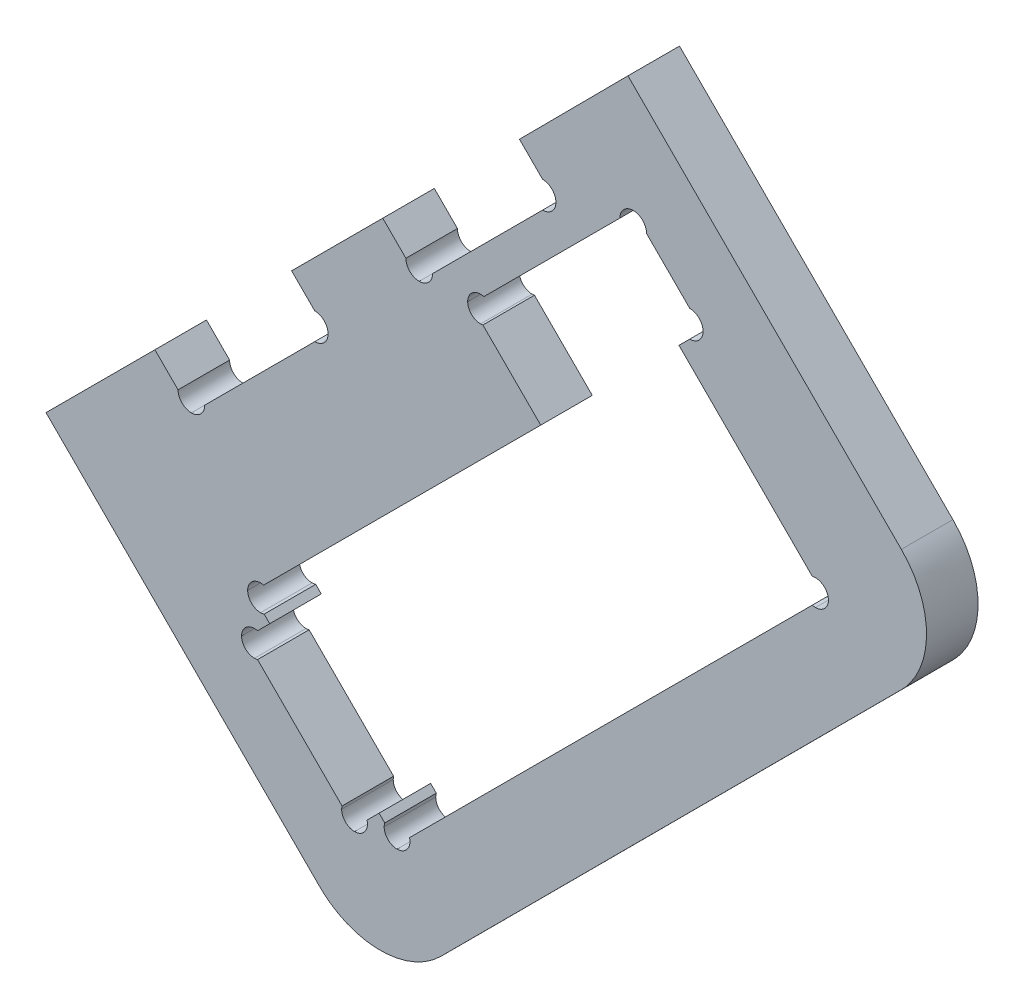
ISO-10303-21;
HEADER;
FILE_DESCRIPTION(('STEP AP214'),'2;1');
FILE_NAME('part.step','',(''),(''),'','','');
FILE_SCHEMA(('AUTOMOTIVE_DESIGN { 1 0 10303 214 1 1 1 1 }'));
ENDSEC;
DATA;
#1=APPLICATION_CONTEXT('core data for automotive mechanical design processes');
#2=APPLICATION_PROTOCOL_DEFINITION('international standard','automotive_design',2000,#1);
#3=PRODUCT_CONTEXT('',#1,'mechanical');
#4=PRODUCT('Part','Part','',(#3));
#5=PRODUCT_RELATED_PRODUCT_CATEGORY('part','',(#4));
#6=PRODUCT_DEFINITION_FORMATION('','',#4);
#7=PRODUCT_DEFINITION_CONTEXT('part definition',#1,'design');
#8=PRODUCT_DEFINITION('design','',#6,#7);
#9=PRODUCT_DEFINITION_SHAPE('','',#8);
#10=(LENGTH_UNIT() NAMED_UNIT(*) SI_UNIT(.MILLI.,.METRE.));
#11=(NAMED_UNIT(*) PLANE_ANGLE_UNIT() SI_UNIT($,.RADIAN.));
#12=(NAMED_UNIT(*) SI_UNIT($,.STERADIAN.) SOLID_ANGLE_UNIT());
#13=UNCERTAINTY_MEASURE_WITH_UNIT(LENGTH_MEASURE(1.E-05),#10,'distance_accuracy_value','');
#14=(GEOMETRIC_REPRESENTATION_CONTEXT(3) GLOBAL_UNCERTAINTY_ASSIGNED_CONTEXT((#13)) GLOBAL_UNIT_ASSIGNED_CONTEXT((#10,
#11,#12)) REPRESENTATION_CONTEXT('',''));
#15=CARTESIAN_POINT('',(0.,0.,0.));
#16=DIRECTION('',(0.,0.,1.));
#17=DIRECTION('',(1.,0.,0.));
#18=AXIS2_PLACEMENT_3D('',#15,#16,#17);
#19=CARTESIAN_POINT('',(2193.9458869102,-121.487784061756,6.));
#20=CARTESIAN_POINT('',(2193.9458869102,-120.631742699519,6.));
#21=CARTESIAN_POINT('',(2193.25192827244,-119.937784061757,6.));
#22=CARTESIAN_POINT('',(2192.39588691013,-119.937784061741,6.));
#23=B_SPLINE_CURVE_WITH_KNOTS('',3,(#19,#20,#21,#22),.UNSPECIFIED.,.F.,.F.,(4,4),(21.,22.),.UNSPECIFIED.);
#24=DIRECTION('',(0.,0.,-1.));
#25=VECTOR('',#24,1.);
#26=SURFACE_OF_LINEAR_EXTRUSION('',#23,#25);
#27=CARTESIAN_POINT('',(2193.9458869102,-121.487784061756,0.));
#28=CARTESIAN_POINT('',(2193.9458869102,-120.631742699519,0.));
#29=CARTESIAN_POINT('',(2193.25192827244,-119.937784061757,0.));
#30=CARTESIAN_POINT('',(2192.39588691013,-119.937784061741,0.));
#31=B_SPLINE_CURVE_WITH_KNOTS('',3,(#27,#28,#29,#30),.UNSPECIFIED.,.F.,.F.,(4,4),(21.,22.),.UNSPECIFIED.);
#32=CARTESIAN_POINT('',(2193.9458869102,-121.487784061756,0.));
#33=VERTEX_POINT('',#32);
#34=CARTESIAN_POINT('',(2192.39588691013,-119.937784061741,0.));
#35=VERTEX_POINT('',#34);
#36=EDGE_CURVE('E722',#33,#35,#31,.T.);
#37=ORIENTED_EDGE('',*,*,#36,.F.);
#38=DIRECTION('',(0.,0.,-1.));
#39=VECTOR('',#38,1.);
#40=CARTESIAN_POINT('',(2193.9458869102,-121.487784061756,6.));
#41=LINE('',#40,#39);
#42=CARTESIAN_POINT('',(2193.9458869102,-121.487784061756,6.));
#43=VERTEX_POINT('',#42);
#44=EDGE_CURVE('E11',#43,#33,#41,.T.);
#45=ORIENTED_EDGE('',*,*,#44,.F.);
#46=CARTESIAN_POINT('',(2192.39588691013,-119.937784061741,6.));
#47=VERTEX_POINT('',#46);
#48=EDGE_CURVE('E1015',#43,#47,#23,.T.);
#49=ORIENTED_EDGE('',*,*,#48,.T.);
#50=DIRECTION('',(0.,0.,-1.));
#51=VECTOR('',#50,1.);
#52=CARTESIAN_POINT('',(2192.39588691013,-119.937784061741,6.));
#53=LINE('',#52,#51);
#54=EDGE_CURVE('E56',#47,#35,#53,.T.);
#55=ORIENTED_EDGE('',*,*,#54,.T.);
#56=EDGE_LOOP('',(#37,#45,#49,#55));
#57=FACE_BOUND('',#56,.T.);
#58=ADVANCED_FACE('F36',(#57),#26,.T.);
#59=CARTESIAN_POINT('',(2192.3958869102,-123.037784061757,6.));
#60=CARTESIAN_POINT('',(2193.25192827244,-123.037784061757,6.));
#61=CARTESIAN_POINT('',(2193.9458869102,-122.343825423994,6.));
#62=CARTESIAN_POINT('',(2193.9458869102,-121.487784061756,6.));
#63=B_SPLINE_CURVE_WITH_KNOTS('',3,(#59,#60,#61,#62),.UNSPECIFIED.,.F.,.F.,(4,4),(20.,21.),.UNSPECIFIED.);
#64=DIRECTION('',(0.,0.,-1.));
#65=VECTOR('',#64,1.);
#66=SURFACE_OF_LINEAR_EXTRUSION('',#63,#65);
#67=CARTESIAN_POINT('',(2192.3958869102,-123.037784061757,0.));
#68=CARTESIAN_POINT('',(2193.25192827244,-123.037784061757,0.));
#69=CARTESIAN_POINT('',(2193.9458869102,-122.343825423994,0.));
#70=CARTESIAN_POINT('',(2193.9458869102,-121.487784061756,0.));
#71=B_SPLINE_CURVE_WITH_KNOTS('',3,(#67,#68,#69,#70),.UNSPECIFIED.,.F.,.F.,(4,4),(20.,21.),.UNSPECIFIED.);
#72=CARTESIAN_POINT('',(2192.3958869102,-123.037784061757,0.));
#73=VERTEX_POINT('',#72);
#74=EDGE_CURVE('E726',#73,#33,#71,.T.);
#75=ORIENTED_EDGE('',*,*,#74,.F.);
#76=DIRECTION('',(0.,0.,-1.));
#77=VECTOR('',#76,1.);
#78=CARTESIAN_POINT('',(2192.3958869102,-123.037784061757,6.));
#79=LINE('',#78,#77);
#80=CARTESIAN_POINT('',(2192.3958869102,-123.037784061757,6.));
#81=VERTEX_POINT('',#80);
#82=EDGE_CURVE('E47',#81,#73,#79,.T.);
#83=ORIENTED_EDGE('',*,*,#82,.F.);
#84=EDGE_CURVE('E1017',#81,#43,#63,.T.);
#85=ORIENTED_EDGE('',*,*,#84,.T.);
#86=ORIENTED_EDGE('',*,*,#44,.T.);
#87=EDGE_LOOP('',(#75,#83,#85,#86));
#88=FACE_BOUND('',#87,.T.);
#89=ADVANCED_FACE('F1040',(#88),#66,.T.);
#90=CARTESIAN_POINT('',(1157.71683548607,-1157.71683548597,6.));
#91=DIRECTION('',(-0.707106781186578,0.707106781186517,0.));
#92=DIRECTION('',(-0.707106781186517,-0.707106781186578,0.));
#93=AXIS2_PLACEMENT_3D('',#90,#91,#92);
#94=PLANE('',#93);
#95=DIRECTION('',(0.707106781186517,0.707106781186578,0.));
#96=VECTOR('',#95,1.);
#97=CARTESIAN_POINT('',(1157.71683548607,-1157.71683548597,0.));
#98=LINE('',#97,#96);
#99=CARTESIAN_POINT('',(2179.58598433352,-135.847686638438,0.));
#100=VERTEX_POINT('',#99);
#101=EDGE_CURVE('E734',#100,#73,#98,.T.);
#102=ORIENTED_EDGE('',*,*,#101,.F.);
#103=DIRECTION('',(0.,0.,-1.));
#104=VECTOR('',#103,1.);
#105=CARTESIAN_POINT('',(2179.58598433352,-135.847686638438,6.));
#106=LINE('',#105,#104);
#107=CARTESIAN_POINT('',(2179.58598433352,-135.847686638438,6.));
#108=VERTEX_POINT('',#107);
#109=EDGE_CURVE('E868',#108,#100,#106,.T.);
#110=ORIENTED_EDGE('',*,*,#109,.F.);
#111=DIRECTION('',(0.707106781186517,0.707106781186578,0.));
#112=VECTOR('',#111,1.);
#113=CARTESIAN_POINT('',(1157.71683548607,-1157.71683548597,6.));
#114=LINE('',#113,#112);
#115=EDGE_CURVE('E1884',#108,#81,#114,.T.);
#116=ORIENTED_EDGE('',*,*,#115,.T.);
#117=ORIENTED_EDGE('',*,*,#82,.T.);
#118=EDGE_LOOP('',(#102,#110,#116,#117));
#119=FACE_BOUND('',#118,.T.);
#120=ADVANCED_FACE('F1487',(#119),#94,.T.);
#121=CARTESIAN_POINT('',(2178.03598433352,-137.397686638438,6.));
#122=CARTESIAN_POINT('',(2178.89202569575,-137.397686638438,6.));
#123=CARTESIAN_POINT('',(2179.58598433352,-136.703728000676,6.));
#124=CARTESIAN_POINT('',(2179.58598433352,-135.847686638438,6.));
#125=B_SPLINE_CURVE_WITH_KNOTS('',3,(#121,#122,#123,#124),.UNSPECIFIED.,.F.,.F.,(4,4),(18.,19.),.UNSPECIFIED.);
#126=DIRECTION('',(0.,0.,-1.));
#127=VECTOR('',#126,1.);
#128=SURFACE_OF_LINEAR_EXTRUSION('',#125,#127);
#129=CARTESIAN_POINT('',(2178.03598433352,-137.397686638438,0.));
#130=CARTESIAN_POINT('',(2178.89202569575,-137.397686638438,0.));
#131=CARTESIAN_POINT('',(2179.58598433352,-136.703728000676,0.));
#132=CARTESIAN_POINT('',(2179.58598433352,-135.847686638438,0.));
#133=B_SPLINE_CURVE_WITH_KNOTS('',3,(#129,#130,#131,#132),.UNSPECIFIED.,.F.,.F.,(4,4),(18.,19.),.UNSPECIFIED.);
#134=CARTESIAN_POINT('',(2178.03598433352,-137.397686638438,0.));
#135=VERTEX_POINT('',#134);
#136=EDGE_CURVE('E740',#135,#100,#133,.T.);
#137=ORIENTED_EDGE('',*,*,#136,.F.);
#138=DIRECTION('',(0.,0.,-1.));
#139=VECTOR('',#138,1.);
#140=CARTESIAN_POINT('',(2178.03598433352,-137.397686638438,6.));
#141=LINE('',#140,#139);
#142=CARTESIAN_POINT('',(2178.03598433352,-137.397686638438,6.));
#143=VERTEX_POINT('',#142);
#144=EDGE_CURVE('E866',#143,#135,#141,.T.);
#145=ORIENTED_EDGE('',*,*,#144,.F.);
#146=EDGE_CURVE('E1885',#143,#108,#125,.T.);
#147=ORIENTED_EDGE('',*,*,#146,.T.);
#148=ORIENTED_EDGE('',*,*,#109,.T.);
#149=EDGE_LOOP('',(#137,#145,#147,#148));
#150=FACE_BOUND('',#149,.T.);
#151=ADVANCED_FACE('F1478',(#150),#128,.T.);
#152=CARTESIAN_POINT('',(2176.48598433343,-135.847686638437,6.));
#153=CARTESIAN_POINT('',(2176.48598433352,-136.703728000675,6.));
#154=CARTESIAN_POINT('',(2177.17994297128,-137.397686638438,6.));
#155=CARTESIAN_POINT('',(2178.03598433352,-137.397686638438,6.));
#156=B_SPLINE_CURVE_WITH_KNOTS('',3,(#152,#153,#154,#155),.UNSPECIFIED.,.F.,.F.,(4,4),(17.,18.),.UNSPECIFIED.);
#157=DIRECTION('',(0.,0.,-1.));
#158=VECTOR('',#157,1.);
#159=SURFACE_OF_LINEAR_EXTRUSION('',#156,#158);
#160=CARTESIAN_POINT('',(2176.48598433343,-135.847686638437,0.));
#161=CARTESIAN_POINT('',(2176.48598433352,-136.703728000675,0.));
#162=CARTESIAN_POINT('',(2177.17994297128,-137.397686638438,0.));
#163=CARTESIAN_POINT('',(2178.03598433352,-137.397686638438,0.));
#164=B_SPLINE_CURVE_WITH_KNOTS('',3,(#160,#161,#162,#163),.UNSPECIFIED.,.F.,.F.,(4,4),(17.,18.),.UNSPECIFIED.);
#165=CARTESIAN_POINT('',(2176.48598433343,-135.847686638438,0.));
#166=VERTEX_POINT('',#165);
#167=EDGE_CURVE('E745',#166,#135,#164,.T.);
#168=ORIENTED_EDGE('',*,*,#167,.F.);
#169=DIRECTION('',(0.,0.,-1.));
#170=VECTOR('',#169,1.);
#171=CARTESIAN_POINT('',(2176.48598433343,-135.847686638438,6.));
#172=LINE('',#171,#170);
#173=CARTESIAN_POINT('',(2176.48598433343,-135.847686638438,6.));
#174=VERTEX_POINT('',#173);
#175=EDGE_CURVE('E864',#174,#166,#172,.T.);
#176=ORIENTED_EDGE('',*,*,#175,.F.);
#177=EDGE_CURVE('E1887',#174,#143,#156,.T.);
#178=ORIENTED_EDGE('',*,*,#177,.T.);
#179=ORIENTED_EDGE('',*,*,#144,.T.);
#180=EDGE_LOOP('',(#168,#176,#178,#179));
#181=FACE_BOUND('',#180,.T.);
#182=ADVANCED_FACE('F1469',(#181),#159,.T.);
#183=CARTESIAN_POINT('',(1020.31914884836,1020.31914884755,6.));
#184=DIRECTION('',(0.707106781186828,0.707106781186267,0.));
#185=DIRECTION('',(-0.707106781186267,0.707106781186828,0.));
#186=AXIS2_PLACEMENT_3D('',#183,#184,#185);
#187=PLANE('',#186);
#188=DIRECTION('',(0.707106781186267,-0.707106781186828,0.));
#189=VECTOR('',#188,1.);
#190=CARTESIAN_POINT('',(1020.31914884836,1020.31914884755,0.));
#191=LINE('',#190,#189);
#192=CARTESIAN_POINT('',(2173.79334364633,-133.155045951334,0.));
#193=VERTEX_POINT('',#192);
#194=EDGE_CURVE('E753',#193,#166,#191,.T.);
#195=ORIENTED_EDGE('',*,*,#194,.F.);
#196=DIRECTION('',(0.,0.,-1.));
#197=VECTOR('',#196,1.);
#198=CARTESIAN_POINT('',(2173.79334364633,-133.155045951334,6.));
#199=LINE('',#198,#197);
#200=CARTESIAN_POINT('',(2173.79334364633,-133.155045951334,6.));
#201=VERTEX_POINT('',#200);
#202=EDGE_CURVE('E862',#201,#193,#199,.T.);
#203=ORIENTED_EDGE('',*,*,#202,.F.);
#204=DIRECTION('',(0.707106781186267,-0.707106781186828,0.));
#205=VECTOR('',#204,1.);
#206=CARTESIAN_POINT('',(1020.31914884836,1020.31914884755,6.));
#207=LINE('',#206,#205);
#208=EDGE_CURVE('E1914',#201,#174,#207,.T.);
#209=ORIENTED_EDGE('',*,*,#208,.T.);
#210=ORIENTED_EDGE('',*,*,#175,.T.);
#211=EDGE_LOOP('',(#195,#203,#209,#210));
#212=FACE_BOUND('',#211,.T.);
#213=ADVANCED_FACE('F1460',(#212),#187,.T.);
#214=CARTESIAN_POINT('',(1153.47419479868,-1153.47419479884,6.));
#215=DIRECTION('',(-0.707106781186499,0.707106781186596,0.));
#216=DIRECTION('',(-0.707106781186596,-0.707106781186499,0.));
#217=AXIS2_PLACEMENT_3D('',#214,#215,#216);
#218=PLANE('',#217);
#219=DIRECTION('',(0.707106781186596,0.707106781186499,0.));
#220=VECTOR('',#219,1.);
#221=CARTESIAN_POINT('',(1153.47419479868,-1153.47419479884,0.));
#222=LINE('',#221,#220);
#223=CARTESIAN_POINT('',(2161.11840002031,-145.829989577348,0.));
#224=VERTEX_POINT('',#223);
#225=EDGE_CURVE('E759',#224,#193,#222,.T.);
#226=ORIENTED_EDGE('',*,*,#225,.F.);
#227=DIRECTION('',(0.,0.,-1.));
#228=VECTOR('',#227,1.);
#229=CARTESIAN_POINT('',(2161.11840002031,-145.829989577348,6.));
#230=LINE('',#229,#228);
#231=CARTESIAN_POINT('',(2161.11840002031,-145.829989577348,6.));
#232=VERTEX_POINT('',#231);
#233=EDGE_CURVE('E860',#232,#224,#230,.T.);
#234=ORIENTED_EDGE('',*,*,#233,.F.);
#235=DIRECTION('',(0.707106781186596,0.707106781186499,0.));
#236=VECTOR('',#235,1.);
#237=CARTESIAN_POINT('',(1153.47419479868,-1153.47419479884,6.));
#238=LINE('',#237,#236);
#239=EDGE_CURVE('E1912',#232,#201,#238,.T.);
#240=ORIENTED_EDGE('',*,*,#239,.T.);
#241=ORIENTED_EDGE('',*,*,#202,.T.);
#242=EDGE_LOOP('',(#226,#234,#240,#241));
#243=FACE_BOUND('',#242,.T.);
#244=ADVANCED_FACE('F1451',(#243),#218,.T.);
#245=CARTESIAN_POINT('',(1007.64420522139,1007.64420522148,6.));
#246=DIRECTION('',(-0.707106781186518,-0.707106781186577,0.));
#247=DIRECTION('',(0.707106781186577,-0.707106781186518,0.));
#248=AXIS2_PLACEMENT_3D('',#245,#246,#247);
#249=PLANE('',#248);
#250=DIRECTION('',(-0.707106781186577,0.707106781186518,0.));
#251=VECTOR('',#250,1.);
#252=CARTESIAN_POINT('',(1007.64420522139,1007.64420522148,0.));
#253=LINE('',#252,#251);
#254=CARTESIAN_POINT('',(2192.93820517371,-177.649794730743,0.));
#255=VERTEX_POINT('',#254);
#256=EDGE_CURVE('E762',#255,#224,#253,.T.);
#257=ORIENTED_EDGE('',*,*,#256,.F.);
#258=DIRECTION('',(0.,0.,-1.));
#259=VECTOR('',#258,1.);
#260=CARTESIAN_POINT('',(2192.93820517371,-177.649794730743,6.));
#261=LINE('',#260,#259);
#262=CARTESIAN_POINT('',(2192.93820517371,-177.649794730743,6.));
#263=VERTEX_POINT('',#262);
#264=EDGE_CURVE('E858',#263,#255,#261,.T.);
#265=ORIENTED_EDGE('',*,*,#264,.F.);
#266=DIRECTION('',(-0.707106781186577,0.707106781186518,0.));
#267=VECTOR('',#266,1.);
#268=CARTESIAN_POINT('',(1007.64420522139,1007.64420522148,6.));
#269=LINE('',#268,#267);
#270=EDGE_CURVE('E1906',#263,#232,#269,.T.);
#271=ORIENTED_EDGE('',*,*,#270,.T.);
#272=ORIENTED_EDGE('',*,*,#233,.T.);
#273=EDGE_LOOP('',(#257,#265,#271,#272));
#274=FACE_BOUND('',#273,.T.);
#275=ADVANCED_FACE('F1442',(#274),#249,.T.);
#276=CARTESIAN_POINT('',(2207.08034079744,-177.649794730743,6.));
#277=CARTESIAN_POINT('',(2203.17509787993,-181.555037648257,6.));
#278=CARTESIAN_POINT('',(2196.84344809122,-181.555037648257,6.));
#279=CARTESIAN_POINT('',(2192.93820517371,-177.649794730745,6.));
#280=B_SPLINE_CURVE_WITH_KNOTS('',3,(#276,#277,#278,#279),.UNSPECIFIED.,.F.,.F.,(4,4),(13.,14.),.UNSPECIFIED.);
#281=DIRECTION('',(0.,0.,-1.));
#282=VECTOR('',#281,1.);
#283=SURFACE_OF_LINEAR_EXTRUSION('',#280,#282);
#284=CARTESIAN_POINT('',(2207.08034079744,-177.649794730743,0.));
#285=CARTESIAN_POINT('',(2203.17509787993,-181.555037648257,0.));
#286=CARTESIAN_POINT('',(2196.84344809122,-181.555037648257,0.));
#287=CARTESIAN_POINT('',(2192.93820517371,-177.649794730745,0.));
#288=B_SPLINE_CURVE_WITH_KNOTS('',3,(#284,#285,#286,#287),.UNSPECIFIED.,.F.,.F.,(4,4),(13.,14.),.UNSPECIFIED.);
#289=CARTESIAN_POINT('',(2207.08034079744,-177.649794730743,0.));
#290=VERTEX_POINT('',#289);
#291=EDGE_CURVE('E765',#290,#255,#288,.T.);
#292=ORIENTED_EDGE('',*,*,#291,.F.);
#293=DIRECTION('',(0.,0.,-1.));
#294=VECTOR('',#293,1.);
#295=CARTESIAN_POINT('',(2207.08034079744,-177.649794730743,6.));
#296=LINE('',#295,#294);
#297=CARTESIAN_POINT('',(2207.08034079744,-177.649794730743,6.));
#298=VERTEX_POINT('',#297);
#299=EDGE_CURVE('E856',#298,#290,#296,.T.);
#300=ORIENTED_EDGE('',*,*,#299,.F.);
#301=EDGE_CURVE('E1900',#298,#263,#280,.T.);
#302=ORIENTED_EDGE('',*,*,#301,.T.);
#303=ORIENTED_EDGE('',*,*,#264,.T.);
#304=EDGE_LOOP('',(#292,#300,#302,#303));
#305=FACE_BOUND('',#304,.T.);
#306=ADVANCED_FACE('F1433',(#305),#283,.T.);
#307=CARTESIAN_POINT('',(1194.0445491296,-1192.22859842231,6.));
#308=DIRECTION('',(0.70764468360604,-0.706568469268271,0.));
#309=DIRECTION('',(0.706568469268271,0.70764468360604,0.));
#310=AXIS2_PLACEMENT_3D('',#307,#308,#309);
#311=PLANE('',#310);
#312=DIRECTION('',(-0.706568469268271,-0.70764468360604,0.));
#313=VECTOR('',#312,1.);
#314=CARTESIAN_POINT('',(1194.0445491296,-1192.22859842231,0.));
#315=LINE('',#314,#313);
#316=CARTESIAN_POINT('',(2260.66506969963,-123.983447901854,0.));
#317=VERTEX_POINT('',#316);
#318=EDGE_CURVE('E770',#317,#290,#315,.T.);
#319=ORIENTED_EDGE('',*,*,#318,.F.);
#320=DIRECTION('',(0.,0.,-1.));
#321=VECTOR('',#320,1.);
#322=CARTESIAN_POINT('',(2260.66506969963,-123.983447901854,6.));
#323=LINE('',#322,#321);
#324=CARTESIAN_POINT('',(2260.66506969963,-123.983447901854,6.));
#325=VERTEX_POINT('',#324);
#326=EDGE_CURVE('E854',#325,#317,#323,.T.);
#327=ORIENTED_EDGE('',*,*,#326,.F.);
#328=DIRECTION('',(-0.706568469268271,-0.70764468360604,0.));
#329=VECTOR('',#328,1.);
#330=CARTESIAN_POINT('',(1194.0445491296,-1192.22859842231,6.));
#331=LINE('',#330,#329);
#332=EDGE_CURVE('E1856',#325,#298,#331,.T.);
#333=ORIENTED_EDGE('',*,*,#332,.T.);
#334=ORIENTED_EDGE('',*,*,#299,.T.);
#335=EDGE_LOOP('',(#319,#327,#333,#334));
#336=FACE_BOUND('',#335,.T.);
#337=ADVANCED_FACE('F1424',(#336),#311,.T.);
#338=CARTESIAN_POINT('',(2260.66506969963,-109.841312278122,6.));
#339=CARTESIAN_POINT('',(2264.57031261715,-113.746555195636,6.));
#340=CARTESIAN_POINT('',(2264.57031261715,-120.07820498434,6.));
#341=CARTESIAN_POINT('',(2260.66506969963,-123.983447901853,6.));
#342=B_SPLINE_CURVE_WITH_KNOTS('',3,(#338,#339,#340,#341),.UNSPECIFIED.,.F.,.F.,(4,4),(11.,12.),.UNSPECIFIED.);
#343=DIRECTION('',(0.,0.,-1.));
#344=VECTOR('',#343,1.);
#345=SURFACE_OF_LINEAR_EXTRUSION('',#342,#344);
#346=CARTESIAN_POINT('',(2260.66506969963,-109.841312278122,0.));
#347=CARTESIAN_POINT('',(2264.57031261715,-113.746555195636,0.));
#348=CARTESIAN_POINT('',(2264.57031261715,-120.07820498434,0.));
#349=CARTESIAN_POINT('',(2260.66506969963,-123.983447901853,0.));
#350=B_SPLINE_CURVE_WITH_KNOTS('',3,(#346,#347,#348,#349),.UNSPECIFIED.,.F.,.F.,(4,4),(11.,12.),.UNSPECIFIED.);
#351=CARTESIAN_POINT('',(2260.66506969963,-109.841312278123,0.));
#352=VERTEX_POINT('',#351);
#353=EDGE_CURVE('E776',#352,#317,#350,.T.);
#354=ORIENTED_EDGE('',*,*,#353,.F.);
#355=DIRECTION('',(0.,0.,-1.));
#356=VECTOR('',#355,1.);
#357=CARTESIAN_POINT('',(2260.66506969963,-109.841312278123,6.));
#358=LINE('',#357,#356);
#359=CARTESIAN_POINT('',(2260.66506969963,-109.841312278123,6.));
#360=VERTEX_POINT('',#359);
#361=EDGE_CURVE('E852',#360,#352,#358,.T.);
#362=ORIENTED_EDGE('',*,*,#361,.F.);
#363=EDGE_CURVE('E1848',#360,#325,#342,.T.);
#364=ORIENTED_EDGE('',*,*,#363,.T.);
#365=ORIENTED_EDGE('',*,*,#326,.T.);
#366=EDGE_LOOP('',(#354,#362,#364,#365));
#367=FACE_BOUND('',#366,.T.);
#368=ADVANCED_FACE('F1415',(#367),#345,.T.);
#369=CARTESIAN_POINT('',(1075.41187871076,1075.41187871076,6.));
#370=DIRECTION('',(0.707106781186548,0.707106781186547,0.));
#371=DIRECTION('',(-0.707106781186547,0.707106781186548,0.));
#372=AXIS2_PLACEMENT_3D('',#369,#370,#371);
#373=PLANE('',#372);
#374=DIRECTION('',(0.707106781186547,-0.707106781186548,0.));
#375=VECTOR('',#374,1.);
#376=CARTESIAN_POINT('',(1075.41187871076,1075.41187871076,0.));
#377=LINE('',#376,#375);
#378=CARTESIAN_POINT('',(2228.84526454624,-78.0215071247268,0.));
#379=VERTEX_POINT('',#378);
#380=EDGE_CURVE('E781',#379,#352,#377,.T.);
#381=ORIENTED_EDGE('',*,*,#380,.F.);
#382=DIRECTION('',(0.,0.,-1.));
#383=VECTOR('',#382,1.);
#384=CARTESIAN_POINT('',(2228.84526454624,-78.0215071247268,6.));
#385=LINE('',#384,#383);
#386=CARTESIAN_POINT('',(2228.84526454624,-78.0215071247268,6.));
#387=VERTEX_POINT('',#386);
#388=EDGE_CURVE('E850',#387,#379,#385,.T.);
#389=ORIENTED_EDGE('',*,*,#388,.F.);
#390=DIRECTION('',(0.707106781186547,-0.707106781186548,0.));
#391=VECTOR('',#390,1.);
#392=CARTESIAN_POINT('',(1075.41187871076,1075.41187871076,6.));
#393=LINE('',#392,#391);
#394=EDGE_CURVE('E1855',#387,#360,#393,.T.);
#395=ORIENTED_EDGE('',*,*,#394,.T.);
#396=ORIENTED_EDGE('',*,*,#361,.T.);
#397=EDGE_LOOP('',(#381,#389,#395,#396));
#398=FACE_BOUND('',#397,.T.);
#399=ADVANCED_FACE('F1406',(#398),#373,.T.);
#400=CARTESIAN_POINT('',(1160.61350136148,-1153.15887918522,6.));
#401=DIRECTION('',(-0.709381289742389,0.704824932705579,0.));
#402=DIRECTION('',(-0.70482493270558,-0.709381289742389,0.));
#403=AXIS2_PLACEMENT_3D('',#400,#401,#402);
#404=PLANE('',#403);
#405=DIRECTION('',(0.70482493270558,0.709381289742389,0.));
#406=VECTOR('',#405,1.);
#407=CARTESIAN_POINT('',(1160.61350136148,-1153.15887918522,0.));
#408=LINE('',#407,#406);
#409=CARTESIAN_POINT('',(2216.21975051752,-90.728639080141,0.));
#410=VERTEX_POINT('',#409);
#411=EDGE_CURVE('E787',#410,#379,#408,.T.);
#412=ORIENTED_EDGE('',*,*,#411,.F.);
#413=DIRECTION('',(0.,0.,-1.));
#414=VECTOR('',#413,1.);
#415=CARTESIAN_POINT('',(2216.21975051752,-90.728639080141,6.));
#416=LINE('',#415,#414);
#417=CARTESIAN_POINT('',(2216.21975051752,-90.728639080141,6.));
#418=VERTEX_POINT('',#417);
#419=EDGE_CURVE('E848',#418,#410,#416,.T.);
#420=ORIENTED_EDGE('',*,*,#419,.F.);
#421=DIRECTION('',(0.70482493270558,0.709381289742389,0.));
#422=VECTOR('',#421,1.);
#423=CARTESIAN_POINT('',(1160.61350136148,-1153.15887918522,6.));
#424=LINE('',#423,#422);
#425=EDGE_CURVE('E1863',#418,#387,#424,.T.);
#426=ORIENTED_EDGE('',*,*,#425,.T.);
#427=ORIENTED_EDGE('',*,*,#388,.T.);
#428=EDGE_LOOP('',(#412,#420,#426,#427));
#429=FACE_BOUND('',#428,.T.);
#430=ADVANCED_FACE('F1397',(#429),#404,.T.);
#431=CARTESIAN_POINT('',(1062.74555571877,1062.74555571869,6.));
#432=DIRECTION('',(-0.707106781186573,-0.707106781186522,0.));
#433=DIRECTION('',(0.707106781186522,-0.707106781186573,0.));
#434=AXIS2_PLACEMENT_3D('',#431,#432,#433);
#435=PLANE('',#434);
#436=DIRECTION('',(-0.707106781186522,0.707106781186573,0.));
#437=VECTOR('',#436,1.);
#438=CARTESIAN_POINT('',(1062.74555571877,1062.74555571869,0.));
#439=LINE('',#438,#437);
#440=CARTESIAN_POINT('',(2218.91239120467,-93.4212797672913,0.));
#441=VERTEX_POINT('',#440);
#442=EDGE_CURVE('E790',#441,#410,#439,.T.);
#443=ORIENTED_EDGE('',*,*,#442,.F.);
#444=DIRECTION('',(0.,0.,-1.));
#445=VECTOR('',#444,1.);
#446=CARTESIAN_POINT('',(2218.91239120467,-93.4212797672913,6.));
#447=LINE('',#446,#445);
#448=CARTESIAN_POINT('',(2218.91239120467,-93.4212797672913,6.));
#449=VERTEX_POINT('',#448);
#450=EDGE_CURVE('E846',#449,#441,#447,.T.);
#451=ORIENTED_EDGE('',*,*,#450,.F.);
#452=DIRECTION('',(-0.707106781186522,0.707106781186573,0.));
#453=VECTOR('',#452,1.);
#454=CARTESIAN_POINT('',(1062.74555571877,1062.74555571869,6.));
#455=LINE('',#454,#453);
#456=EDGE_CURVE('E1865',#449,#418,#455,.T.);
#457=ORIENTED_EDGE('',*,*,#456,.T.);
#458=ORIENTED_EDGE('',*,*,#419,.T.);
#459=EDGE_LOOP('',(#443,#451,#457,#458));
#460=FACE_BOUND('',#459,.T.);
#461=ADVANCED_FACE('F1388',(#460),#435,.T.);
#462=CARTESIAN_POINT('',(2220.4623912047,-94.9712797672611,6.));
#463=CARTESIAN_POINT('',(2220.46239120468,-94.115238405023,6.));
#464=CARTESIAN_POINT('',(2219.76843256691,-93.4212797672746,6.));
#465=CARTESIAN_POINT('',(2218.91239120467,-93.4212797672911,6.));
#466=B_SPLINE_CURVE_WITH_KNOTS('',3,(#462,#463,#464,#465),.UNSPECIFIED.,.F.,.F.,(4,4),(7.,8.),.UNSPECIFIED.);
#467=DIRECTION('',(0.,0.,-1.));
#468=VECTOR('',#467,1.);
#469=SURFACE_OF_LINEAR_EXTRUSION('',#466,#468);
#470=CARTESIAN_POINT('',(2220.4623912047,-94.9712797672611,0.));
#471=CARTESIAN_POINT('',(2220.46239120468,-94.115238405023,0.));
#472=CARTESIAN_POINT('',(2219.76843256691,-93.4212797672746,0.));
#473=CARTESIAN_POINT('',(2218.91239120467,-93.4212797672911,0.));
#474=B_SPLINE_CURVE_WITH_KNOTS('',3,(#470,#471,#472,#473),.UNSPECIFIED.,.F.,.F.,(4,4),(7.,8.),.UNSPECIFIED.);
#475=CARTESIAN_POINT('',(2220.4623912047,-94.9712797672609,0.));
#476=VERTEX_POINT('',#475);
#477=EDGE_CURVE('E793',#476,#441,#474,.T.);
#478=ORIENTED_EDGE('',*,*,#477,.F.);
#479=DIRECTION('',(0.,0.,-1.));
#480=VECTOR('',#479,1.);
#481=CARTESIAN_POINT('',(2220.4623912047,-94.9712797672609,6.));
#482=LINE('',#481,#480);
#483=CARTESIAN_POINT('',(2220.4623912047,-94.9712797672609,6.));
#484=VERTEX_POINT('',#483);
#485=EDGE_CURVE('E844',#484,#476,#482,.T.);
#486=ORIENTED_EDGE('',*,*,#485,.F.);
#487=EDGE_CURVE('E1839',#484,#449,#466,.T.);
#488=ORIENTED_EDGE('',*,*,#487,.T.);
#489=ORIENTED_EDGE('',*,*,#450,.T.);
#490=EDGE_LOOP('',(#478,#486,#488,#489));
#491=FACE_BOUND('',#490,.T.);
#492=ADVANCED_FACE('F1379',(#491),#469,.T.);
#493=CARTESIAN_POINT('',(2218.91239120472,-96.5212797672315,6.));
#494=CARTESIAN_POINT('',(2219.76843256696,-96.5212797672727,6.));
#495=CARTESIAN_POINT('',(2220.46239120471,-95.8273211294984,6.));
#496=CARTESIAN_POINT('',(2220.4623912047,-94.9712797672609,6.));
#497=B_SPLINE_CURVE_WITH_KNOTS('',3,(#493,#494,#495,#496),.UNSPECIFIED.,.F.,.F.,(4,4),(6.,7.),.UNSPECIFIED.);
#498=DIRECTION('',(0.,0.,-1.));
#499=VECTOR('',#498,1.);
#500=SURFACE_OF_LINEAR_EXTRUSION('',#497,#499);
#501=CARTESIAN_POINT('',(2218.91239120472,-96.5212797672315,0.));
#502=CARTESIAN_POINT('',(2219.76843256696,-96.5212797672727,0.));
#503=CARTESIAN_POINT('',(2220.46239120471,-95.8273211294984,0.));
#504=CARTESIAN_POINT('',(2220.4623912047,-94.9712797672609,0.));
#505=B_SPLINE_CURVE_WITH_KNOTS('',3,(#501,#502,#503,#504),.UNSPECIFIED.,.F.,.F.,(4,4),(6.,7.),.UNSPECIFIED.);
#506=CARTESIAN_POINT('',(2218.91239120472,-96.5212797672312,0.));
#507=VERTEX_POINT('',#506);
#508=EDGE_CURVE('E798',#507,#476,#505,.T.);
#509=ORIENTED_EDGE('',*,*,#508,.F.);
#510=DIRECTION('',(0.,0.,-1.));
#511=VECTOR('',#510,1.);
#512=CARTESIAN_POINT('',(2218.91239120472,-96.5212797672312,6.));
#513=LINE('',#512,#511);
#514=CARTESIAN_POINT('',(2218.91239120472,-96.5212797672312,6.));
#515=VERTEX_POINT('',#514);
#516=EDGE_CURVE('E842',#515,#507,#513,.T.);
#517=ORIENTED_EDGE('',*,*,#516,.F.);
#518=EDGE_CURVE('E1833',#515,#484,#497,.T.);
#519=ORIENTED_EDGE('',*,*,#518,.T.);
#520=ORIENTED_EDGE('',*,*,#485,.T.);
#521=EDGE_LOOP('',(#509,#517,#519,#520));
#522=FACE_BOUND('',#521,.T.);
#523=ADVANCED_FACE('F1370',(#522),#500,.T.);
#524=CARTESIAN_POINT('',(1157.71683548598,-1157.71683548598,6.));
#525=DIRECTION('',(-0.707106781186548,0.707106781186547,0.));
#526=DIRECTION('',(-0.707106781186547,-0.707106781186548,0.));
#527=AXIS2_PLACEMENT_3D('',#524,#525,#526);
#528=PLANE('',#527);
#529=DIRECTION('',(0.707106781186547,0.707106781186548,0.));
#530=VECTOR('',#529,1.);
#531=CARTESIAN_POINT('',(1157.71683548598,-1157.71683548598,0.));
#532=LINE('',#531,#530);
#533=CARTESIAN_POINT('',(2206.10248862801,-109.331182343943,0.));
#534=VERTEX_POINT('',#533);
#535=EDGE_CURVE('E806',#534,#507,#532,.T.);
#536=ORIENTED_EDGE('',*,*,#535,.F.);
#537=DIRECTION('',(0.,0.,-1.));
#538=VECTOR('',#537,1.);
#539=CARTESIAN_POINT('',(2206.10248862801,-109.331182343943,6.));
#540=LINE('',#539,#538);
#541=CARTESIAN_POINT('',(2206.10248862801,-109.331182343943,6.));
#542=VERTEX_POINT('',#541);
#543=EDGE_CURVE('E840',#542,#534,#540,.T.);
#544=ORIENTED_EDGE('',*,*,#543,.F.);
#545=DIRECTION('',(0.707106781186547,0.707106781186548,0.));
#546=VECTOR('',#545,1.);
#547=CARTESIAN_POINT('',(1157.71683548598,-1157.71683548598,6.));
#548=LINE('',#547,#546);
#549=EDGE_CURVE('E1827',#542,#515,#548,.T.);
#550=ORIENTED_EDGE('',*,*,#549,.T.);
#551=ORIENTED_EDGE('',*,*,#516,.T.);
#552=EDGE_LOOP('',(#536,#544,#550,#551));
#553=FACE_BOUND('',#552,.T.);
#554=ADVANCED_FACE('F1361',(#553),#528,.T.);
#555=CARTESIAN_POINT('',(2204.55248862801,-110.881182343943,6.));
#556=CARTESIAN_POINT('',(2205.40852999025,-110.881182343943,6.));
#557=CARTESIAN_POINT('',(2206.10248862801,-110.18722370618,6.));
#558=CARTESIAN_POINT('',(2206.10248862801,-109.331182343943,6.));
#559=B_SPLINE_CURVE_WITH_KNOTS('',3,(#555,#556,#557,#558),.UNSPECIFIED.,.F.,.F.,(4,4),(4.,5.),.UNSPECIFIED.);
#560=DIRECTION('',(0.,0.,-1.));
#561=VECTOR('',#560,1.);
#562=SURFACE_OF_LINEAR_EXTRUSION('',#559,#561);
#563=CARTESIAN_POINT('',(2204.55248862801,-110.881182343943,0.));
#564=CARTESIAN_POINT('',(2205.40852999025,-110.881182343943,0.));
#565=CARTESIAN_POINT('',(2206.10248862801,-110.18722370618,0.));
#566=CARTESIAN_POINT('',(2206.10248862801,-109.331182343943,0.));
#567=B_SPLINE_CURVE_WITH_KNOTS('',3,(#563,#564,#565,#566),.UNSPECIFIED.,.F.,.F.,(4,4),(4.,5.),.UNSPECIFIED.);
#568=CARTESIAN_POINT('',(2204.55248862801,-110.881182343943,0.));
#569=VERTEX_POINT('',#568);
#570=EDGE_CURVE('E812',#569,#534,#567,.T.);
#571=ORIENTED_EDGE('',*,*,#570,.F.);
#572=DIRECTION('',(0.,0.,-1.));
#573=VECTOR('',#572,1.);
#574=CARTESIAN_POINT('',(2204.55248862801,-110.881182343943,6.));
#575=LINE('',#574,#573);
#576=CARTESIAN_POINT('',(2204.55248862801,-110.881182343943,6.));
#577=VERTEX_POINT('',#576);
#578=EDGE_CURVE('E838',#577,#569,#575,.T.);
#579=ORIENTED_EDGE('',*,*,#578,.F.);
#580=EDGE_CURVE('E1818',#577,#542,#559,.T.);
#581=ORIENTED_EDGE('',*,*,#580,.T.);
#582=ORIENTED_EDGE('',*,*,#543,.T.);
#583=EDGE_LOOP('',(#571,#579,#581,#582));
#584=FACE_BOUND('',#583,.T.);
#585=ADVANCED_FACE('F1352',(#584),#562,.T.);
#586=CARTESIAN_POINT('',(2203.00248862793,-109.33118234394,6.));
#587=CARTESIAN_POINT('',(2203.00248862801,-110.187223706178,6.));
#588=CARTESIAN_POINT('',(2203.69644726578,-110.881182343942,6.));
#589=CARTESIAN_POINT('',(2204.55248862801,-110.881182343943,6.));
#590=B_SPLINE_CURVE_WITH_KNOTS('',3,(#586,#587,#588,#589),.UNSPECIFIED.,.F.,.F.,(4,4),(3.,4.),.UNSPECIFIED.);
#591=DIRECTION('',(0.,0.,-1.));
#592=VECTOR('',#591,1.);
#593=SURFACE_OF_LINEAR_EXTRUSION('',#590,#592);
#594=CARTESIAN_POINT('',(2203.00248862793,-109.33118234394,0.));
#595=CARTESIAN_POINT('',(2203.00248862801,-110.187223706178,0.));
#596=CARTESIAN_POINT('',(2203.69644726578,-110.881182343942,0.));
#597=CARTESIAN_POINT('',(2204.55248862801,-110.881182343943,0.));
#598=B_SPLINE_CURVE_WITH_KNOTS('',3,(#594,#595,#596,#597),.UNSPECIFIED.,.F.,.F.,(4,4),(3.,4.),.UNSPECIFIED.);
#599=CARTESIAN_POINT('',(2203.00248862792,-109.331182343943,0.));
#600=VERTEX_POINT('',#599);
#601=EDGE_CURVE('E817',#600,#569,#598,.T.);
#602=ORIENTED_EDGE('',*,*,#601,.F.);
#603=DIRECTION('',(0.,0.,-1.));
#604=VECTOR('',#603,1.);
#605=CARTESIAN_POINT('',(2203.00248862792,-109.331182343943,6.));
#606=LINE('',#605,#604);
#607=CARTESIAN_POINT('',(2203.00248862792,-109.331182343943,6.));
#608=VERTEX_POINT('',#607);
#609=EDGE_CURVE('E442',#608,#600,#606,.T.);
#610=ORIENTED_EDGE('',*,*,#609,.F.);
#611=EDGE_CURVE('E453',#608,#577,#590,.T.);
#612=ORIENTED_EDGE('',*,*,#611,.T.);
#613=ORIENTED_EDGE('',*,*,#578,.T.);
#614=EDGE_LOOP('',(#602,#610,#612,#613));
#615=FACE_BOUND('',#614,.T.);
#616=ADVANCED_FACE('F1344',(#615),#593,.T.);
#617=CARTESIAN_POINT('',(1046.83565314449,1046.83565314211,6.));
#618=DIRECTION('',(0.707106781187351,0.707106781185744,0.));
#619=DIRECTION('',(-0.707106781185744,0.707106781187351,0.));
#620=AXIS2_PLACEMENT_3D('',#617,#618,#619);
#621=PLANE('',#620);
#622=DIRECTION('',(0.707106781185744,-0.707106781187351,0.));
#623=VECTOR('',#622,1.);
#624=CARTESIAN_POINT('',(1046.83565314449,1046.83565314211,0.));
#625=LINE('',#624,#623);
#626=CARTESIAN_POINT('',(2200.30984794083,-106.638541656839,0.));
#627=VERTEX_POINT('',#626);
#628=EDGE_CURVE('E438',#627,#600,#625,.T.);
#629=ORIENTED_EDGE('',*,*,#628,.F.);
#630=DIRECTION('',(0.,0.,-1.));
#631=VECTOR('',#630,1.);
#632=CARTESIAN_POINT('',(2200.30984794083,-106.638541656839,6.));
#633=LINE('',#632,#631);
#634=CARTESIAN_POINT('',(2200.30984794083,-106.638541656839,6.));
#635=VERTEX_POINT('',#634);
#636=EDGE_CURVE('E433',#635,#627,#633,.T.);
#637=ORIENTED_EDGE('',*,*,#636,.F.);
#638=DIRECTION('',(0.707106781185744,-0.707106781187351,0.));
#639=VECTOR('',#638,1.);
#640=CARTESIAN_POINT('',(1046.83565314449,1046.83565314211,6.));
#641=LINE('',#640,#639);
#642=EDGE_CURVE('E436',#635,#608,#641,.T.);
#643=ORIENTED_EDGE('',*,*,#642,.T.);
#644=ORIENTED_EDGE('',*,*,#609,.T.);
#645=EDGE_LOOP('',(#629,#637,#643,#644));
#646=FACE_BOUND('',#645,.T.);
#647=ADVANCED_FACE('F435',(#646),#621,.T.);
#648=CARTESIAN_POINT('',(1153.47419479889,-1153.47419479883,6.));
#649=DIRECTION('',(-0.707106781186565,0.70710678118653,0.));
#650=DIRECTION('',(-0.70710678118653,-0.707106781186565,0.));
#651=AXIS2_PLACEMENT_3D('',#648,#649,#650);
#652=PLANE('',#651);
#653=DIRECTION('',(0.70710678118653,0.707106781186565,0.));
#654=VECTOR('',#653,1.);
#655=CARTESIAN_POINT('',(1153.47419479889,-1153.47419479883,0.));
#656=LINE('',#655,#654);
#657=CARTESIAN_POINT('',(2189.70324622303,-117.245143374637,0.));
#658=VERTEX_POINT('',#657);
#659=EDGE_CURVE('E829',#658,#627,#656,.T.);
#660=ORIENTED_EDGE('',*,*,#659,.F.);
#661=DIRECTION('',(0.,0.,-1.));
#662=VECTOR('',#661,1.);
#663=CARTESIAN_POINT('',(2189.70324622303,-117.245143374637,6.));
#664=LINE('',#663,#662);
#665=CARTESIAN_POINT('',(2189.70324622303,-117.245143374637,6.));
#666=VERTEX_POINT('',#665);
#667=EDGE_CURVE('E243',#666,#658,#664,.T.);
#668=ORIENTED_EDGE('',*,*,#667,.F.);
#669=DIRECTION('',(0.70710678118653,0.707106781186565,0.));
#670=VECTOR('',#669,1.);
#671=CARTESIAN_POINT('',(1153.47419479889,-1153.47419479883,6.));
#672=LINE('',#671,#670);
#673=EDGE_CURVE('E450',#666,#635,#672,.T.);
#674=ORIENTED_EDGE('',*,*,#673,.T.);
#675=ORIENTED_EDGE('',*,*,#636,.T.);
#676=EDGE_LOOP('',(#660,#668,#674,#675));
#677=FACE_BOUND('',#676,.T.);
#678=ADVANCED_FACE('F455',(#677),#652,.T.);
#679=CARTESIAN_POINT('',(2185.3806506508,-158.45712191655,6.));
#680=CARTESIAN_POINT('',(2185.5046303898,-158.457106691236,6.));
#681=CARTESIAN_POINT('',(2185.62320514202,-158.437800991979,6.));
#682=CARTESIAN_POINT('',(2185.73838464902,-158.409497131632,6.));
#683=B_SPLINE_CURVE_WITH_KNOTS('',3,(#679,#680,#681,#682),.UNSPECIFIED.,.F.,.F.,(4,4),(39.,40.),.UNSPECIFIED.);
#684=DIRECTION('',(0.,0.,-1.));
#685=VECTOR('',#684,1.);
#686=SURFACE_OF_LINEAR_EXTRUSION('',#683,#685);
#687=CARTESIAN_POINT('',(2185.3806506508,-158.45712191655,0.));
#688=CARTESIAN_POINT('',(2185.5046303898,-158.457106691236,0.));
#689=CARTESIAN_POINT('',(2185.62320514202,-158.437800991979,0.));
#690=CARTESIAN_POINT('',(2185.73838464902,-158.409497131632,0.));
#691=B_SPLINE_CURVE_WITH_KNOTS('',3,(#687,#688,#689,#690),.UNSPECIFIED.,.F.,.F.,(4,4),(39.,40.),.UNSPECIFIED.);
#692=CARTESIAN_POINT('',(2185.3806506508,-158.45712191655,0.));
#693=VERTEX_POINT('',#692);
#694=CARTESIAN_POINT('',(2185.73838464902,-158.409497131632,0.));
#695=VERTEX_POINT('',#694);
#696=EDGE_CURVE('E462',#693,#695,#691,.T.);
#697=ORIENTED_EDGE('',*,*,#696,.F.);
#698=DIRECTION('',(0.,0.,-1.));
#699=VECTOR('',#698,1.);
#700=CARTESIAN_POINT('',(2185.3806506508,-158.45712191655,6.));
#701=LINE('',#700,#699);
#702=CARTESIAN_POINT('',(2185.3806506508,-158.45712191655,6.));
#703=VERTEX_POINT('',#702);
#704=EDGE_CURVE('E41',#703,#693,#701,.T.);
#705=ORIENTED_EDGE('',*,*,#704,.F.);
#706=CARTESIAN_POINT('',(2185.73838464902,-158.409497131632,6.));
#707=VERTEX_POINT('',#706);
#708=EDGE_CURVE('E834',#703,#707,#683,.T.);
#709=ORIENTED_EDGE('',*,*,#708,.T.);
#710=DIRECTION('',(0.,0.,-1.));
#711=VECTOR('',#710,1.);
#712=CARTESIAN_POINT('',(2185.73838464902,-158.409497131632,6.));
#713=LINE('',#712,#711);
#714=EDGE_CURVE('E458',#707,#695,#713,.T.);
#715=ORIENTED_EDGE('',*,*,#714,.T.);
#716=EDGE_LOOP('',(#697,#705,#709,#715));
#717=FACE_BOUND('',#716,.T.);
#718=ADVANCED_FACE('F38',(#717),#686,.T.);
#719=CARTESIAN_POINT('',(2183.88065262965,-156.957123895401,6.));
#720=CARTESIAN_POINT('',(2183.88062217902,-157.785594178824,6.));
#721=CARTESIAN_POINT('',(2184.55218036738,-158.457152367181,6.));
#722=CARTESIAN_POINT('',(2185.3806506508,-158.45712191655,6.));
#723=B_SPLINE_CURVE_WITH_KNOTS('',3,(#719,#720,#721,#722),.UNSPECIFIED.,.F.,.F.,(4,4),(38.,39.),.UNSPECIFIED.);
#724=DIRECTION('',(0.,0.,-1.));
#725=VECTOR('',#724,1.);
#726=SURFACE_OF_LINEAR_EXTRUSION('',#723,#725);
#727=CARTESIAN_POINT('',(2183.88065262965,-156.957123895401,0.));
#728=CARTESIAN_POINT('',(2183.88062217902,-157.785594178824,0.));
#729=CARTESIAN_POINT('',(2184.55218036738,-158.457152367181,0.));
#730=CARTESIAN_POINT('',(2185.3806506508,-158.45712191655,0.));
#731=B_SPLINE_CURVE_WITH_KNOTS('',3,(#727,#728,#729,#730),.UNSPECIFIED.,.F.,.F.,(4,4),(38.,39.),.UNSPECIFIED.);
#732=CARTESIAN_POINT('',(2183.88065262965,-156.957123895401,0.));
#733=VERTEX_POINT('',#732);
#734=EDGE_CURVE('E467',#733,#693,#731,.T.);
#735=ORIENTED_EDGE('',*,*,#734,.F.);
#736=DIRECTION('',(0.,0.,-1.));
#737=VECTOR('',#736,1.);
#738=CARTESIAN_POINT('',(2183.88065262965,-156.957123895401,6.));
#739=LINE('',#738,#737);
#740=CARTESIAN_POINT('',(2183.88065262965,-156.957123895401,6.));
#741=VERTEX_POINT('',#740);
#742=EDGE_CURVE('E945',#741,#733,#739,.T.);
#743=ORIENTED_EDGE('',*,*,#742,.F.);
#744=EDGE_CURVE('E954',#741,#703,#723,.T.);
#745=ORIENTED_EDGE('',*,*,#744,.T.);
#746=ORIENTED_EDGE('',*,*,#704,.T.);
#747=EDGE_LOOP('',(#735,#743,#745,#746));
#748=FACE_BOUND('',#747,.T.);
#749=ADVANCED_FACE('F952',(#748),#726,.T.);
#750=CARTESIAN_POINT('',(2185.3806506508,-155.457125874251,6.));
#751=CARTESIAN_POINT('',(2184.55218036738,-155.45715632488,6.));
#752=CARTESIAN_POINT('',(2183.88068308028,-156.128653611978,6.));
#753=CARTESIAN_POINT('',(2183.88065262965,-156.957123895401,6.));
#754=B_SPLINE_CURVE_WITH_KNOTS('',3,(#750,#751,#752,#753),.UNSPECIFIED.,.F.,.F.,(4,4),(37.,38.),.UNSPECIFIED.);
#755=DIRECTION('',(0.,0.,-1.));
#756=VECTOR('',#755,1.);
#757=SURFACE_OF_LINEAR_EXTRUSION('',#754,#756);
#758=CARTESIAN_POINT('',(2185.3806506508,-155.457125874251,0.));
#759=CARTESIAN_POINT('',(2184.55218036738,-155.45715632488,0.));
#760=CARTESIAN_POINT('',(2183.88068308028,-156.128653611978,0.));
#761=CARTESIAN_POINT('',(2183.88065262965,-156.957123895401,0.));
#762=B_SPLINE_CURVE_WITH_KNOTS('',3,(#758,#759,#760,#761),.UNSPECIFIED.,.F.,.F.,(4,4),(37.,38.),.UNSPECIFIED.);
#763=CARTESIAN_POINT('',(2185.3806506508,-155.457125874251,0.));
#764=VERTEX_POINT('',#763);
#765=EDGE_CURVE('E475',#764,#733,#762,.T.);
#766=ORIENTED_EDGE('',*,*,#765,.F.);
#767=DIRECTION('',(0.,0.,-1.));
#768=VECTOR('',#767,1.);
#769=CARTESIAN_POINT('',(2185.3806506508,-155.457125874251,6.));
#770=LINE('',#769,#768);
#771=CARTESIAN_POINT('',(2185.3806506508,-155.457125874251,6.));
#772=VERTEX_POINT('',#771);
#773=EDGE_CURVE('E944',#772,#764,#770,.T.);
#774=ORIENTED_EDGE('',*,*,#773,.F.);
#775=EDGE_CURVE('E962',#772,#741,#754,.T.);
#776=ORIENTED_EDGE('',*,*,#775,.T.);
#777=ORIENTED_EDGE('',*,*,#742,.T.);
#778=EDGE_LOOP('',(#766,#774,#776,#777));
#779=FACE_BOUND('',#778,.T.);
#780=ADVANCED_FACE('F960',(#779),#757,.T.);
#781=CARTESIAN_POINT('',(2185.73823239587,-155.504842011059,6.));
#782=CARTESIAN_POINT('',(2185.62312901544,-155.476462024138,6.));
#783=CARTESIAN_POINT('',(2185.50459993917,-155.457080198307,6.));
#784=CARTESIAN_POINT('',(2185.3806506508,-155.457125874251,6.));
#785=B_SPLINE_CURVE_WITH_KNOTS('',3,(#781,#782,#783,#784),.UNSPECIFIED.,.F.,.F.,(4,4),(36.,37.),.UNSPECIFIED.);
#786=DIRECTION('',(0.,0.,-1.));
#787=VECTOR('',#786,1.);
#788=SURFACE_OF_LINEAR_EXTRUSION('',#785,#787);
#789=CARTESIAN_POINT('',(2185.73823239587,-155.504842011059,0.));
#790=CARTESIAN_POINT('',(2185.62312901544,-155.476462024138,0.));
#791=CARTESIAN_POINT('',(2185.50459993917,-155.457080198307,0.));
#792=CARTESIAN_POINT('',(2185.3806506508,-155.457125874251,0.));
#793=B_SPLINE_CURVE_WITH_KNOTS('',3,(#789,#790,#791,#792),.UNSPECIFIED.,.F.,.F.,(4,4),(36.,37.),.UNSPECIFIED.);
#794=CARTESIAN_POINT('',(2185.73823239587,-155.504842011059,0.));
#795=VERTEX_POINT('',#794);
#796=EDGE_CURVE('E483',#795,#764,#793,.T.);
#797=ORIENTED_EDGE('',*,*,#796,.F.);
#798=DIRECTION('',(0.,0.,-1.));
#799=VECTOR('',#798,1.);
#800=CARTESIAN_POINT('',(2185.73823239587,-155.504842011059,6.));
#801=LINE('',#800,#799);
#802=CARTESIAN_POINT('',(2185.73823239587,-155.504842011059,6.));
#803=VERTEX_POINT('',#802);
#804=EDGE_CURVE('E942',#803,#795,#801,.T.);
#805=ORIENTED_EDGE('',*,*,#804,.F.);
#806=EDGE_CURVE('E968',#803,#772,#785,.T.);
#807=ORIENTED_EDGE('',*,*,#806,.T.);
#808=ORIENTED_EDGE('',*,*,#773,.T.);
#809=EDGE_LOOP('',(#797,#805,#807,#808));
#810=FACE_BOUND('',#809,.T.);
#811=ADVANCED_FACE('F971',(#810),#788,.T.);
#812=CARTESIAN_POINT('',(1170.62153720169,-1170.62153720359,6.));
#813=DIRECTION('',(0.707106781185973,-0.707106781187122,0.));
#814=DIRECTION('',(0.707106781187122,0.707106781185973,0.));
#815=AXIS2_PLACEMENT_3D('',#812,#813,#814);
#816=PLANE('',#815);
#817=DIRECTION('',(-0.707106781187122,-0.707106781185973,0.));
#818=VECTOR('',#817,1.);
#819=CARTESIAN_POINT('',(1170.62153720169,-1170.62153720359,0.));
#820=LINE('',#819,#818);
#821=CARTESIAN_POINT('',(2187.15564830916,-154.087426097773,0.));
#822=VERTEX_POINT('',#821);
#823=EDGE_CURVE('E491',#822,#795,#820,.T.);
#824=ORIENTED_EDGE('',*,*,#823,.F.);
#825=DIRECTION('',(0.,0.,-1.));
#826=VECTOR('',#825,1.);
#827=CARTESIAN_POINT('',(2187.15564830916,-154.087426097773,6.));
#828=LINE('',#827,#826);
#829=CARTESIAN_POINT('',(2187.15564830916,-154.087426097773,6.));
#830=VERTEX_POINT('',#829);
#831=EDGE_CURVE('E940',#830,#822,#828,.T.);
#832=ORIENTED_EDGE('',*,*,#831,.F.);
#833=DIRECTION('',(-0.707106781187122,-0.707106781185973,0.));
#834=VECTOR('',#833,1.);
#835=CARTESIAN_POINT('',(1170.62153720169,-1170.62153720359,6.));
#836=LINE('',#835,#834);
#837=EDGE_CURVE('E972',#830,#803,#836,.T.);
#838=ORIENTED_EDGE('',*,*,#837,.T.);
#839=ORIENTED_EDGE('',*,*,#804,.T.);
#840=EDGE_LOOP('',(#824,#832,#838,#839));
#841=FACE_BOUND('',#840,.T.);
#842=ADVANCED_FACE('F991',(#841),#816,.T.);
#843=CARTESIAN_POINT('',(1016.53411110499,1016.53411110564,6.));
#844=DIRECTION('',(0.70710678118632,0.707106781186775,0.));
#845=DIRECTION('',(-0.707106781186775,0.70710678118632,0.));
#846=AXIS2_PLACEMENT_3D('',#843,#844,#845);
#847=PLANE('',#846);
#848=DIRECTION('',(0.707106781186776,-0.70710678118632,0.));
#849=VECTOR('',#848,1.);
#850=CARTESIAN_POINT('',(1016.53411110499,1016.53411110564,0.));
#851=LINE('',#850,#849);
#852=CARTESIAN_POINT('',(2186.5100949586,-153.441872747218,0.));
#853=VERTEX_POINT('',#852);
#854=EDGE_CURVE('E497',#853,#822,#851,.T.);
#855=ORIENTED_EDGE('',*,*,#854,.F.);
#856=DIRECTION('',(0.,0.,-1.));
#857=VECTOR('',#856,1.);
#858=CARTESIAN_POINT('',(2186.5100949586,-153.441872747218,6.));
#859=LINE('',#858,#857);
#860=CARTESIAN_POINT('',(2186.5100949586,-153.441872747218,6.));
#861=VERTEX_POINT('',#860);
#862=EDGE_CURVE('E938',#861,#853,#859,.T.);
#863=ORIENTED_EDGE('',*,*,#862,.F.);
#864=DIRECTION('',(0.707106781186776,-0.70710678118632,0.));
#865=VECTOR('',#864,1.);
#866=CARTESIAN_POINT('',(1016.53411110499,1016.53411110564,6.));
#867=LINE('',#866,#865);
#868=EDGE_CURVE('E974',#861,#830,#867,.T.);
#869=ORIENTED_EDGE('',*,*,#868,.T.);
#870=ORIENTED_EDGE('',*,*,#831,.T.);
#871=EDGE_LOOP('',(#855,#863,#869,#870));
#872=FACE_BOUND('',#871,.T.);
#873=ADVANCED_FACE('F1283',(#872),#847,.T.);
#874=CARTESIAN_POINT('',(2186.08734886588,-153.509747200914,6.));
#875=CARTESIAN_POINT('',(2186.2352018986,-153.509731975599,6.));
#876=CARTESIAN_POINT('',(2186.37522911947,-153.481671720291,6.));
#877=CARTESIAN_POINT('',(2186.5100949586,-153.441872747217,6.));
#878=B_SPLINE_CURVE_WITH_KNOTS('',3,(#874,#875,#876,#877),.UNSPECIFIED.,.F.,.F.,(4,4),(33.,34.),.UNSPECIFIED.);
#879=DIRECTION('',(0.,0.,-1.));
#880=VECTOR('',#879,1.);
#881=SURFACE_OF_LINEAR_EXTRUSION('',#878,#880);
#882=CARTESIAN_POINT('',(2186.08734886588,-153.509747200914,0.));
#883=CARTESIAN_POINT('',(2186.2352018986,-153.509731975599,0.));
#884=CARTESIAN_POINT('',(2186.37522911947,-153.481671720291,0.));
#885=CARTESIAN_POINT('',(2186.5100949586,-153.441872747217,0.));
#886=B_SPLINE_CURVE_WITH_KNOTS('',3,(#882,#883,#884,#885),.UNSPECIFIED.,.F.,.F.,(4,4),(33.,34.),.UNSPECIFIED.);
#887=CARTESIAN_POINT('',(2186.08734886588,-153.509747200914,0.));
#888=VERTEX_POINT('',#887);
#889=EDGE_CURVE('E500',#888,#853,#886,.T.);
#890=ORIENTED_EDGE('',*,*,#889,.F.);
#891=DIRECTION('',(0.,0.,-1.));
#892=VECTOR('',#891,1.);
#893=CARTESIAN_POINT('',(2186.08734886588,-153.509747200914,6.));
#894=LINE('',#893,#892);
#895=CARTESIAN_POINT('',(2186.08734886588,-153.509747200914,6.));
#896=VERTEX_POINT('',#895);
#897=EDGE_CURVE('E936',#896,#888,#894,.T.);
#898=ORIENTED_EDGE('',*,*,#897,.F.);
#899=EDGE_CURVE('E1279',#896,#861,#878,.T.);
#900=ORIENTED_EDGE('',*,*,#899,.T.);
#901=ORIENTED_EDGE('',*,*,#862,.T.);
#902=EDGE_LOOP('',(#890,#898,#900,#901));
#903=FACE_BOUND('',#902,.T.);
#904=ADVANCED_FACE('F1276',(#903),#881,.T.);
#905=CARTESIAN_POINT('',(2184.58735084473,-152.009749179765,6.));
#906=CARTESIAN_POINT('',(2184.58744219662,-152.838097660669,6.));
#907=CARTESIAN_POINT('',(2185.25900038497,-153.509655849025,6.));
#908=CARTESIAN_POINT('',(2186.08734886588,-153.509747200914,6.));
#909=B_SPLINE_CURVE_WITH_KNOTS('',3,(#905,#906,#907,#908),.UNSPECIFIED.,.F.,.F.,(4,4),(32.,33.),.UNSPECIFIED.);
#910=DIRECTION('',(0.,0.,-1.));
#911=VECTOR('',#910,1.);
#912=SURFACE_OF_LINEAR_EXTRUSION('',#909,#911);
#913=CARTESIAN_POINT('',(2184.58735084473,-152.009749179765,0.));
#914=CARTESIAN_POINT('',(2184.58744219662,-152.838097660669,0.));
#915=CARTESIAN_POINT('',(2185.25900038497,-153.509655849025,0.));
#916=CARTESIAN_POINT('',(2186.08734886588,-153.509747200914,0.));
#917=B_SPLINE_CURVE_WITH_KNOTS('',3,(#913,#914,#915,#916),.UNSPECIFIED.,.F.,.F.,(4,4),(32.,33.),.UNSPECIFIED.);
#918=CARTESIAN_POINT('',(2184.58735084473,-152.009749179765,0.));
#919=VERTEX_POINT('',#918);
#920=EDGE_CURVE('E505',#919,#888,#917,.T.);
#921=ORIENTED_EDGE('',*,*,#920,.F.);
#922=DIRECTION('',(0.,0.,-1.));
#923=VECTOR('',#922,1.);
#924=CARTESIAN_POINT('',(2184.58735084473,-152.009749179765,6.));
#925=LINE('',#924,#923);
#926=CARTESIAN_POINT('',(2184.58735084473,-152.009749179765,6.));
#927=VERTEX_POINT('',#926);
#928=EDGE_CURVE('E934',#927,#919,#925,.T.);
#929=ORIENTED_EDGE('',*,*,#928,.F.);
#930=EDGE_CURVE('E1286',#927,#896,#909,.T.);
#931=ORIENTED_EDGE('',*,*,#930,.T.);
#932=ORIENTED_EDGE('',*,*,#897,.T.);
#933=EDGE_LOOP('',(#921,#929,#931,#932));
#934=FACE_BOUND('',#933,.T.);
#935=ADVANCED_FACE('F1272',(#934),#912,.T.);
#936=CARTESIAN_POINT('',(2186.0874706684,-150.509629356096,6.));
#937=CARTESIAN_POINT('',(2185.25900038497,-150.509659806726,6.));
#938=CARTESIAN_POINT('',(2184.58738129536,-151.181278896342,6.));
#939=CARTESIAN_POINT('',(2184.58735084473,-152.009749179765,6.));
#940=B_SPLINE_CURVE_WITH_KNOTS('',3,(#936,#937,#938,#939),.UNSPECIFIED.,.F.,.F.,(4,4),(31.,32.),.UNSPECIFIED.);
#941=DIRECTION('',(0.,0.,-1.));
#942=VECTOR('',#941,1.);
#943=SURFACE_OF_LINEAR_EXTRUSION('',#940,#942);
#944=CARTESIAN_POINT('',(2186.0874706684,-150.509629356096,0.));
#945=CARTESIAN_POINT('',(2185.25900038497,-150.509659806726,0.));
#946=CARTESIAN_POINT('',(2184.58738129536,-151.181278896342,0.));
#947=CARTESIAN_POINT('',(2184.58735084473,-152.009749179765,0.));
#948=B_SPLINE_CURVE_WITH_KNOTS('',3,(#944,#945,#946,#947),.UNSPECIFIED.,.F.,.F.,(4,4),(31.,32.),.UNSPECIFIED.);
#949=CARTESIAN_POINT('',(2186.0874706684,-150.509629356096,0.));
#950=VERTEX_POINT('',#949);
#951=EDGE_CURVE('E513',#950,#919,#948,.T.);
#952=ORIENTED_EDGE('',*,*,#951,.F.);
#953=DIRECTION('',(0.,0.,-1.));
#954=VECTOR('',#953,1.);
#955=CARTESIAN_POINT('',(2186.0874706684,-150.509629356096,6.));
#956=LINE('',#955,#954);
#957=CARTESIAN_POINT('',(2186.0874706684,-150.509629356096,6.));
#958=VERTEX_POINT('',#957);
#959=EDGE_CURVE('E932',#958,#950,#956,.T.);
#960=ORIENTED_EDGE('',*,*,#959,.F.);
#961=EDGE_CURVE('E1268',#958,#927,#940,.T.);
#962=ORIENTED_EDGE('',*,*,#961,.T.);
#963=ORIENTED_EDGE('',*,*,#928,.T.);
#964=EDGE_LOOP('',(#952,#960,#962,#963));
#965=FACE_BOUND('',#964,.T.);
#966=ADVANCED_FACE('F1266',(#965),#943,.T.);
#967=CARTESIAN_POINT('',(2186.44357555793,-150.556843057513,6.));
#968=CARTESIAN_POINT('',(2186.32882235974,-150.528813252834,6.));
#969=CARTESIAN_POINT('',(2186.21078049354,-150.509675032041,6.));
#970=CARTESIAN_POINT('',(2186.0874706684,-150.509629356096,6.));
#971=B_SPLINE_CURVE_WITH_KNOTS('',3,(#967,#968,#969,#970),.UNSPECIFIED.,.F.,.F.,(4,4),(30.,31.),.UNSPECIFIED.);
#972=DIRECTION('',(0.,0.,-1.));
#973=VECTOR('',#972,1.);
#974=SURFACE_OF_LINEAR_EXTRUSION('',#971,#973);
#975=CARTESIAN_POINT('',(2186.44357555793,-150.556843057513,0.));
#976=CARTESIAN_POINT('',(2186.32882235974,-150.528813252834,0.));
#977=CARTESIAN_POINT('',(2186.21078049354,-150.509675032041,0.));
#978=CARTESIAN_POINT('',(2186.0874706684,-150.509629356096,0.));
#979=B_SPLINE_CURVE_WITH_KNOTS('',3,(#975,#976,#977,#978),.UNSPECIFIED.,.F.,.F.,(4,4),(30.,31.),.UNSPECIFIED.);
#980=CARTESIAN_POINT('',(2186.44357555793,-150.556843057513,0.));
#981=VERTEX_POINT('',#980);
#982=EDGE_CURVE('E521',#981,#950,#979,.T.);
#983=ORIENTED_EDGE('',*,*,#982,.F.);
#984=DIRECTION('',(0.,0.,-1.));
#985=VECTOR('',#984,1.);
#986=CARTESIAN_POINT('',(2186.44357555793,-150.556843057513,6.));
#987=LINE('',#986,#985);
#988=CARTESIAN_POINT('',(2186.44357555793,-150.556843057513,6.));
#989=VERTEX_POINT('',#988);
#990=EDGE_CURVE('E930',#989,#981,#987,.T.);
#991=ORIENTED_EDGE('',*,*,#990,.F.);
#992=EDGE_CURVE('E1262',#989,#958,#971,.T.);
#993=ORIENTED_EDGE('',*,*,#992,.T.);
#994=ORIENTED_EDGE('',*,*,#959,.T.);
#995=EDGE_LOOP('',(#983,#991,#993,#994));
#996=FACE_BOUND('',#995,.T.);
#997=ADVANCED_FACE('F1259',(#996),#974,.T.);
#998=CARTESIAN_POINT('',(1168.50020930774,-1168.50020930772,6.));
#999=DIRECTION('',(0.707106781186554,-0.707106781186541,0.));
#1000=DIRECTION('',(0.707106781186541,0.707106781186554,0.));
#1001=AXIS2_PLACEMENT_3D('',#998,#999,#1000);
#1002=PLANE('',#1001);
#1003=DIRECTION('',(-0.707106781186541,-0.707106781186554,0.));
#1004=VECTOR('',#1003,1.);
#1005=CARTESIAN_POINT('',(1168.50020930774,-1168.50020930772,0.));
#1006=LINE('',#1005,#1004);
#1007=CARTESIAN_POINT('',(2218.69469013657,-118.305728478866,0.));
#1008=VERTEX_POINT('',#1007);
#1009=EDGE_CURVE('E529',#1008,#981,#1006,.T.);
#1010=ORIENTED_EDGE('',*,*,#1009,.F.);
#1011=DIRECTION('',(0.,0.,-1.));
#1012=VECTOR('',#1011,1.);
#1013=CARTESIAN_POINT('',(2218.69469013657,-118.305728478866,6.));
#1014=LINE('',#1013,#1012);
#1015=CARTESIAN_POINT('',(2218.69469013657,-118.305728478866,6.));
#1016=VERTEX_POINT('',#1015);
#1017=EDGE_CURVE('E928',#1016,#1008,#1014,.T.);
#1018=ORIENTED_EDGE('',*,*,#1017,.F.);
#1019=DIRECTION('',(-0.707106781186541,-0.707106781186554,0.));
#1020=VECTOR('',#1019,1.);
#1021=CARTESIAN_POINT('',(1168.50020930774,-1168.50020930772,6.));
#1022=LINE('',#1021,#1020);
#1023=EDGE_CURVE('E2042',#1016,#989,#1022,.T.);
#1024=ORIENTED_EDGE('',*,*,#1023,.T.);
#1025=ORIENTED_EDGE('',*,*,#990,.T.);
#1026=EDGE_LOOP('',(#1010,#1018,#1024,#1025));
#1027=FACE_BOUND('',#1026,.T.);
#1028=ADVANCED_FACE('F1255',(#1027),#1002,.T.);
#1029=CARTESIAN_POINT('',(1050.19448082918,1050.19448082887,6.));
#1030=DIRECTION('',(0.707106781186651,0.707106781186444,0.));
#1031=DIRECTION('',(-0.707106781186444,0.707106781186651,0.));
#1032=AXIS2_PLACEMENT_3D('',#1029,#1030,#1031);
#1033=PLANE('',#1032);
#1034=DIRECTION('',(0.707106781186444,-0.707106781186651,0.));
#1035=VECTOR('',#1034,1.);
#1036=CARTESIAN_POINT('',(1050.19448082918,1050.19448082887,0.));
#1037=LINE('',#1036,#1035);
#1038=CARTESIAN_POINT('',(2211.96462897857,-111.575667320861,0.));
#1039=VERTEX_POINT('',#1038);
#1040=EDGE_CURVE('E535',#1039,#1008,#1037,.T.);
#1041=ORIENTED_EDGE('',*,*,#1040,.F.);
#1042=DIRECTION('',(0.,0.,-1.));
#1043=VECTOR('',#1042,1.);
#1044=CARTESIAN_POINT('',(2211.96462897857,-111.575667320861,6.));
#1045=LINE('',#1044,#1043);
#1046=CARTESIAN_POINT('',(2211.96462897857,-111.575667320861,6.));
#1047=VERTEX_POINT('',#1046);
#1048=EDGE_CURVE('E926',#1047,#1039,#1045,.T.);
#1049=ORIENTED_EDGE('',*,*,#1048,.F.);
#1050=DIRECTION('',(0.707106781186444,-0.707106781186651,0.));
#1051=VECTOR('',#1050,1.);
#1052=CARTESIAN_POINT('',(1050.19448082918,1050.19448082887,6.));
#1053=LINE('',#1052,#1051);
#1054=EDGE_CURVE('E1251',#1047,#1016,#1053,.T.);
#1055=ORIENTED_EDGE('',*,*,#1054,.T.);
#1056=ORIENTED_EDGE('',*,*,#1017,.T.);
#1057=EDGE_LOOP('',(#1041,#1049,#1055,#1056));
#1058=FACE_BOUND('',#1057,.T.);
#1059=ADVANCED_FACE('F1249',(#1058),#1033,.T.);
#1060=CARTESIAN_POINT('',(2211.69296368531,-111.603149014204,6.));
#1061=CARTESIAN_POINT('',(2211.78600558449,-111.603133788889,6.));
#1062=CARTESIAN_POINT('',(2211.87618512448,-111.591973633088,6.));
#1063=CARTESIAN_POINT('',(2211.96462897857,-111.575667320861,6.));
#1064=B_SPLINE_CURVE_WITH_KNOTS('',3,(#1060,#1061,#1062,#1063),.UNSPECIFIED.,.F.,.F.,(4,4),(27.,
28.),.UNSPECIFIED.);
#1065=DIRECTION('',(0.,0.,-1.));
#1066=VECTOR('',#1065,1.);
#1067=SURFACE_OF_LINEAR_EXTRUSION('',#1064,#1066);
#1068=CARTESIAN_POINT('',(2211.69296368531,-111.603149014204,0.));
#1069=CARTESIAN_POINT('',(2211.78600558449,-111.603133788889,0.));
#1070=CARTESIAN_POINT('',(2211.87618512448,-111.591973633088,0.));
#1071=CARTESIAN_POINT('',(2211.96462897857,-111.575667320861,0.));
#1072=B_SPLINE_CURVE_WITH_KNOTS('',3,(#1068,#1069,#1070,#1071),.UNSPECIFIED.,.F.,.F.,(4,4),(27.,
28.),.UNSPECIFIED.);
#1073=CARTESIAN_POINT('',(2211.69296368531,-111.603149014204,0.));
#1074=VERTEX_POINT('',#1073);
#1075=EDGE_CURVE('E538',#1074,#1039,#1072,.T.);
#1076=ORIENTED_EDGE('',*,*,#1075,.F.);
#1077=DIRECTION('',(0.,0.,-1.));
#1078=VECTOR('',#1077,1.);
#1079=CARTESIAN_POINT('',(2211.69296368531,-111.603149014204,6.));
#1080=LINE('',#1079,#1078);
#1081=CARTESIAN_POINT('',(2211.69296368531,-111.603149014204,6.));
#1082=VERTEX_POINT('',#1081);
#1083=EDGE_CURVE('E924',#1082,#1074,#1080,.T.);
#1084=ORIENTED_EDGE('',*,*,#1083,.F.);
#1085=EDGE_CURVE('E1245',#1082,#1047,#1064,.T.);
#1086=ORIENTED_EDGE('',*,*,#1085,.T.);
#1087=ORIENTED_EDGE('',*,*,#1048,.T.);
#1088=EDGE_LOOP('',(#1076,#1084,#1086,#1087));
#1089=FACE_BOUND('',#1088,.T.);
#1090=ADVANCED_FACE('F1242',(#1089),#1067,.T.);
#1091=CARTESIAN_POINT('',(2210.19296566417,-110.103150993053,6.));
#1092=CARTESIAN_POINT('',(2210.19305701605,-110.931499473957,6.));
#1093=CARTESIAN_POINT('',(2210.86461520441,-111.603057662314,6.));
#1094=CARTESIAN_POINT('',(2211.69296368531,-111.603149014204,6.));
#1095=B_SPLINE_CURVE_WITH_KNOTS('',3,(#1091,#1092,#1093,#1094),.UNSPECIFIED.,.F.,.F.,(4,4),(26.,
27.),.UNSPECIFIED.);
#1096=DIRECTION('',(0.,0.,-1.));
#1097=VECTOR('',#1096,1.);
#1098=SURFACE_OF_LINEAR_EXTRUSION('',#1095,#1097);
#1099=CARTESIAN_POINT('',(2210.19296566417,-110.103150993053,0.));
#1100=CARTESIAN_POINT('',(2210.19305701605,-110.931499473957,0.));
#1101=CARTESIAN_POINT('',(2210.86461520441,-111.603057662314,0.));
#1102=CARTESIAN_POINT('',(2211.69296368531,-111.603149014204,0.));
#1103=B_SPLINE_CURVE_WITH_KNOTS('',3,(#1099,#1100,#1101,#1102),.UNSPECIFIED.,.F.,.F.,(4,4),(26.,
27.),.UNSPECIFIED.);
#1104=CARTESIAN_POINT('',(2210.19296566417,-110.103150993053,0.));
#1105=VERTEX_POINT('',#1104);
#1106=EDGE_CURVE('E543',#1105,#1074,#1103,.T.);
#1107=ORIENTED_EDGE('',*,*,#1106,.F.);
#1108=DIRECTION('',(0.,0.,-1.));
#1109=VECTOR('',#1108,1.);
#1110=CARTESIAN_POINT('',(2210.19296566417,-110.103150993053,6.));
#1111=LINE('',#1110,#1109);
#1112=CARTESIAN_POINT('',(2210.19296566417,-110.103150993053,6.));
#1113=VERTEX_POINT('',#1112);
#1114=EDGE_CURVE('E922',#1113,#1105,#1111,.T.);
#1115=ORIENTED_EDGE('',*,*,#1114,.F.);
#1116=EDGE_CURVE('E2027',#1113,#1082,#1095,.T.);
#1117=ORIENTED_EDGE('',*,*,#1116,.T.);
#1118=ORIENTED_EDGE('',*,*,#1083,.T.);
#1119=EDGE_LOOP('',(#1107,#1115,#1117,#1118));
#1120=FACE_BOUND('',#1119,.T.);
#1121=ADVANCED_FACE('F1238',(#1120),#1098,.T.);
#1122=CARTESIAN_POINT('',(2211.69296368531,-108.603152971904,6.));
#1123=CARTESIAN_POINT('',(2210.86461520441,-108.603061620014,6.));
#1124=CARTESIAN_POINT('',(2210.19299611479,-109.27468070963,6.));
#1125=CARTESIAN_POINT('',(2210.19296566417,-110.103150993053,6.));
#1126=B_SPLINE_CURVE_WITH_KNOTS('',3,(#1122,#1123,#1124,#1125),.UNSPECIFIED.,.F.,.F.,(4,4),(25.,
26.),.UNSPECIFIED.);
#1127=DIRECTION('',(0.,0.,-1.));
#1128=VECTOR('',#1127,1.);
#1129=SURFACE_OF_LINEAR_EXTRUSION('',#1126,#1128);
#1130=CARTESIAN_POINT('',(2211.69296368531,-108.603152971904,0.));
#1131=CARTESIAN_POINT('',(2210.86461520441,-108.603061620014,0.));
#1132=CARTESIAN_POINT('',(2210.19299611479,-109.27468070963,0.));
#1133=CARTESIAN_POINT('',(2210.19296566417,-110.103150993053,0.));
#1134=B_SPLINE_CURVE_WITH_KNOTS('',3,(#1130,#1131,#1132,#1133),.UNSPECIFIED.,.F.,.F.,(4,4),(25.,
26.),.UNSPECIFIED.);
#1135=CARTESIAN_POINT('',(2211.69296368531,-108.603152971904,0.));
#1136=VERTEX_POINT('',#1135);
#1137=EDGE_CURVE('E551',#1136,#1105,#1134,.T.);
#1138=ORIENTED_EDGE('',*,*,#1137,.F.);
#1139=DIRECTION('',(0.,0.,-1.));
#1140=VECTOR('',#1139,1.);
#1141=CARTESIAN_POINT('',(2211.69296368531,-108.603152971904,6.));
#1142=LINE('',#1141,#1140);
#1143=CARTESIAN_POINT('',(2211.69296368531,-108.603152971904,6.));
#1144=VERTEX_POINT('',#1143);
#1145=EDGE_CURVE('E920',#1144,#1136,#1142,.T.);
#1146=ORIENTED_EDGE('',*,*,#1145,.F.);
#1147=EDGE_CURVE('E1234',#1144,#1113,#1126,.T.);
#1148=ORIENTED_EDGE('',*,*,#1147,.T.);
#1149=ORIENTED_EDGE('',*,*,#1114,.T.);
#1150=EDGE_LOOP('',(#1138,#1146,#1148,#1149));
#1151=FACE_BOUND('',#1150,.T.);
#1152=ADVANCED_FACE('F1232',(#1151),#1129,.T.);
#1153=CARTESIAN_POINT('',(2212.0778900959,-108.659212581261,6.));
#1154=CARTESIAN_POINT('',(2211.95435189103,-108.626295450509,6.));
#1155=CARTESIAN_POINT('',(2211.82691600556,-108.603122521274,6.));
#1156=CARTESIAN_POINT('',(2211.69296368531,-108.603152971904,6.));
#1157=B_SPLINE_CURVE_WITH_KNOTS('',3,(#1153,#1154,#1155,#1156),.UNSPECIFIED.,.F.,.F.,(4,4),(24.,
25.),.UNSPECIFIED.);
#1158=DIRECTION('',(0.,0.,-1.));
#1159=VECTOR('',#1158,1.);
#1160=SURFACE_OF_LINEAR_EXTRUSION('',#1157,#1159);
#1161=CARTESIAN_POINT('',(2212.0778900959,-108.659212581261,0.));
#1162=CARTESIAN_POINT('',(2211.95435189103,-108.626295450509,0.));
#1163=CARTESIAN_POINT('',(2211.82691600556,-108.603122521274,0.));
#1164=CARTESIAN_POINT('',(2211.69296368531,-108.603152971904,0.));
#1165=B_SPLINE_CURVE_WITH_KNOTS('',3,(#1161,#1162,#1163,#1164),.UNSPECIFIED.,.F.,.F.,(4,4),(24.,
25.),.UNSPECIFIED.);
#1166=CARTESIAN_POINT('',(2212.0778900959,-108.659212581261,0.));
#1167=VERTEX_POINT('',#1166);
#1168=EDGE_CURVE('E559',#1167,#1136,#1165,.T.);
#1169=ORIENTED_EDGE('',*,*,#1168,.F.);
#1170=DIRECTION('',(0.,0.,-1.));
#1171=VECTOR('',#1170,1.);
#1172=CARTESIAN_POINT('',(2212.0778900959,-108.659212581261,6.));
#1173=LINE('',#1172,#1171);
#1174=CARTESIAN_POINT('',(2212.0778900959,-108.659212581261,6.));
#1175=VERTEX_POINT('',#1174);
#1176=EDGE_CURVE('E918',#1175,#1167,#1173,.T.);
#1177=ORIENTED_EDGE('',*,*,#1176,.F.);
#1178=EDGE_CURVE('E1228',#1175,#1144,#1157,.T.);
#1179=ORIENTED_EDGE('',*,*,#1178,.T.);
#1180=ORIENTED_EDGE('',*,*,#1145,.T.);
#1181=EDGE_LOOP('',(#1169,#1177,#1179,#1180));
#1182=FACE_BOUND('',#1181,.T.);
#1183=ADVANCED_FACE('F1225',(#1182),#1160,.T.);
#1184=CARTESIAN_POINT('',(1159.98766606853,-1160.38719501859,6.));
#1185=DIRECTION('',(0.706985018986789,-0.707228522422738,0.));
#1186=DIRECTION('',(0.707228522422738,0.706985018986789,0.));
#1187=AXIS2_PLACEMENT_3D('',#1184,#1185,#1186);
#1188=PLANE('',#1187);
#1189=DIRECTION('',(-0.707228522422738,-0.706985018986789,0.));
#1190=VECTOR('',#1189,1.);
#1191=CARTESIAN_POINT('',(1159.98766606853,-1160.38719501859,0.));
#1192=LINE('',#1191,#1190);
#1193=CARTESIAN_POINT('',(2227.90873096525,-92.8338223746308,0.));
#1194=VERTEX_POINT('',#1193);
#1195=EDGE_CURVE('E567',#1194,#1167,#1192,.T.);
#1196=ORIENTED_EDGE('',*,*,#1195,.F.);
#1197=DIRECTION('',(0.,0.,-1.));
#1198=VECTOR('',#1197,1.);
#1199=CARTESIAN_POINT('',(2227.90873096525,-92.8338223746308,6.));
#1200=LINE('',#1199,#1198);
#1201=CARTESIAN_POINT('',(2227.90873096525,-92.8338223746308,6.));
#1202=VERTEX_POINT('',#1201);
#1203=EDGE_CURVE('E916',#1202,#1194,#1200,.T.);
#1204=ORIENTED_EDGE('',*,*,#1203,.F.);
#1205=DIRECTION('',(-0.707228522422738,-0.706985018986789,0.));
#1206=VECTOR('',#1205,1.);
#1207=CARTESIAN_POINT('',(1159.98766606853,-1160.38719501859,6.));
#1208=LINE('',#1207,#1206);
#1209=EDGE_CURVE('E2013',#1202,#1175,#1208,.T.);
#1210=ORIENTED_EDGE('',*,*,#1209,.T.);
#1211=ORIENTED_EDGE('',*,*,#1176,.T.);
#1212=EDGE_LOOP('',(#1196,#1204,#1210,#1211));
#1213=FACE_BOUND('',#1212,.T.);
#1214=ADVANCED_FACE('F1221',(#1213),#1188,.T.);
#1215=CARTESIAN_POINT('',(2229.4587898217,-91.2837635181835,6.));
#1216=CARTESIAN_POINT('',(2228.60276171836,-91.2837635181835,6.));
#1217=CARTESIAN_POINT('',(2227.90873096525,-91.9777942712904,6.));
#1218=CARTESIAN_POINT('',(2227.90873096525,-92.8338223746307,6.));
#1219=B_SPLINE_CURVE_WITH_KNOTS('',3,(#1215,#1216,#1217,#1218),.UNSPECIFIED.,.F.,.F.,(4,4),(22.,
23.),.UNSPECIFIED.);
#1220=DIRECTION('',(0.,0.,-1.));
#1221=VECTOR('',#1220,1.);
#1222=SURFACE_OF_LINEAR_EXTRUSION('',#1219,#1221);
#1223=CARTESIAN_POINT('',(2229.4587898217,-91.2837635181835,0.));
#1224=CARTESIAN_POINT('',(2228.60276171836,-91.2837635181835,0.));
#1225=CARTESIAN_POINT('',(2227.90873096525,-91.9777942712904,0.));
#1226=CARTESIAN_POINT('',(2227.90873096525,-92.8338223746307,0.));
#1227=B_SPLINE_CURVE_WITH_KNOTS('',3,(#1223,#1224,#1225,#1226),.UNSPECIFIED.,.F.,.F.,(4,4),(22.,
23.),.UNSPECIFIED.);
#1228=CARTESIAN_POINT('',(2229.4587898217,-91.2837635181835,0.));
#1229=VERTEX_POINT('',#1228);
#1230=EDGE_CURVE('E573',#1229,#1194,#1227,.T.);
#1231=ORIENTED_EDGE('',*,*,#1230,.F.);
#1232=DIRECTION('',(0.,0.,-1.));
#1233=VECTOR('',#1232,1.);
#1234=CARTESIAN_POINT('',(2229.4587898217,-91.2837635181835,6.));
#1235=LINE('',#1234,#1233);
#1236=CARTESIAN_POINT('',(2229.4587898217,-91.2837635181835,6.));
#1237=VERTEX_POINT('',#1236);
#1238=EDGE_CURVE('E914',#1237,#1229,#1235,.T.);
#1239=ORIENTED_EDGE('',*,*,#1238,.F.);
#1240=EDGE_CURVE('E1217',#1237,#1202,#1219,.T.);
#1241=ORIENTED_EDGE('',*,*,#1240,.T.);
#1242=ORIENTED_EDGE('',*,*,#1203,.T.);
#1243=EDGE_LOOP('',(#1231,#1239,#1241,#1242));
#1244=FACE_BOUND('',#1243,.T.);
#1245=ADVANCED_FACE('F1215',(#1244),#1222,.T.);
#1246=CARTESIAN_POINT('',(2231.00878777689,-92.8337614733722,6.));
#1247=CARTESIAN_POINT('',(2231.00878777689,-91.9777333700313,6.));
#1248=CARTESIAN_POINT('',(2230.31481792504,-91.2837635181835,6.));
#1249=CARTESIAN_POINT('',(2229.4587898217,-91.2837635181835,6.));
#1250=B_SPLINE_CURVE_WITH_KNOTS('',3,(#1246,#1247,#1248,#1249),.UNSPECIFIED.,.F.,.F.,(4,4),(21.,
22.),.UNSPECIFIED.);
#1251=DIRECTION('',(0.,0.,-1.));
#1252=VECTOR('',#1251,1.);
#1253=SURFACE_OF_LINEAR_EXTRUSION('',#1250,#1252);
#1254=CARTESIAN_POINT('',(2231.00878777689,-92.8337614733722,0.));
#1255=CARTESIAN_POINT('',(2231.00878777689,-91.9777333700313,0.));
#1256=CARTESIAN_POINT('',(2230.31481792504,-91.2837635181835,0.));
#1257=CARTESIAN_POINT('',(2229.4587898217,-91.2837635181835,0.));
#1258=B_SPLINE_CURVE_WITH_KNOTS('',3,(#1254,#1255,#1256,#1257),.UNSPECIFIED.,.F.,.F.,(4,4),(21.,
22.),.UNSPECIFIED.);
#1259=CARTESIAN_POINT('',(2231.00878777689,-92.8337614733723,0.));
#1260=VERTEX_POINT('',#1259);
#1261=EDGE_CURVE('E578',#1260,#1229,#1258,.T.);
#1262=ORIENTED_EDGE('',*,*,#1261,.F.);
#1263=DIRECTION('',(0.,0.,-1.));
#1264=VECTOR('',#1263,1.);
#1265=CARTESIAN_POINT('',(2231.00878777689,-92.8337614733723,6.));
#1266=LINE('',#1265,#1264);
#1267=CARTESIAN_POINT('',(2231.00878777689,-92.8337614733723,6.));
#1268=VERTEX_POINT('',#1267);
#1269=EDGE_CURVE('E912',#1268,#1260,#1266,.T.);
#1270=ORIENTED_EDGE('',*,*,#1269,.F.);
#1271=EDGE_CURVE('E1211',#1268,#1237,#1250,.T.);
#1272=ORIENTED_EDGE('',*,*,#1271,.T.);
#1273=ORIENTED_EDGE('',*,*,#1238,.T.);
#1274=EDGE_LOOP('',(#1262,#1270,#1272,#1273));
#1275=FACE_BOUND('',#1274,.T.);
#1276=ADVANCED_FACE('F1208',(#1275),#1253,.T.);
#1277=CARTESIAN_POINT('',(1069.0875131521,1069.08751315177,6.));
#1278=DIRECTION('',(-0.707106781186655,-0.70710678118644,0.));
#1279=DIRECTION('',(0.70710678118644,-0.707106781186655,0.));
#1280=AXIS2_PLACEMENT_3D('',#1277,#1278,#1279);
#1281=PLANE('',#1280);
#1282=DIRECTION('',(-0.70710678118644,0.707106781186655,0.));
#1283=VECTOR('',#1282,1.);
#1284=CARTESIAN_POINT('',(1069.0875131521,1069.08751315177,0.));
#1285=LINE('',#1284,#1283);
#1286=CARTESIAN_POINT('',(2236.03772450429,-97.8626982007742,0.));
#1287=VERTEX_POINT('',#1286);
#1288=EDGE_CURVE('E586',#1287,#1260,#1285,.T.);
#1289=ORIENTED_EDGE('',*,*,#1288,.F.);
#1290=DIRECTION('',(0.,0.,-1.));
#1291=VECTOR('',#1290,1.);
#1292=CARTESIAN_POINT('',(2236.03772450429,-97.8626982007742,6.));
#1293=LINE('',#1292,#1291);
#1294=CARTESIAN_POINT('',(2236.03772450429,-97.8626982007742,6.));
#1295=VERTEX_POINT('',#1294);
#1296=EDGE_CURVE('E910',#1295,#1287,#1293,.T.);
#1297=ORIENTED_EDGE('',*,*,#1296,.F.);
#1298=DIRECTION('',(-0.70710678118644,0.707106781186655,0.));
#1299=VECTOR('',#1298,1.);
#1300=CARTESIAN_POINT('',(1069.0875131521,1069.08751315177,6.));
#1301=LINE('',#1300,#1299);
#1302=EDGE_CURVE('E2005',#1295,#1268,#1301,.T.);
#1303=ORIENTED_EDGE('',*,*,#1302,.T.);
#1304=ORIENTED_EDGE('',*,*,#1269,.T.);
#1305=EDGE_LOOP('',(#1289,#1297,#1303,#1304));
#1306=FACE_BOUND('',#1305,.T.);
#1307=ADVANCED_FACE('F1204',(#1306),#1281,.T.);
#1308=CARTESIAN_POINT('',(2237.58772245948,-99.4126961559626,6.));
#1309=CARTESIAN_POINT('',(2237.58772245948,-98.5566680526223,6.));
#1310=CARTESIAN_POINT('',(2236.89375260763,-97.8626982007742,6.));
#1311=CARTESIAN_POINT('',(2236.03772450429,-97.8626982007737,6.));
#1312=B_SPLINE_CURVE_WITH_KNOTS('',3,(#1308,#1309,#1310,#1311),.UNSPECIFIED.,.F.,.F.,(4,4),(19.,
20.),.UNSPECIFIED.);
#1313=DIRECTION('',(0.,0.,-1.));
#1314=VECTOR('',#1313,1.);
#1315=SURFACE_OF_LINEAR_EXTRUSION('',#1312,#1314);
#1316=CARTESIAN_POINT('',(2237.58772245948,-99.4126961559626,0.));
#1317=CARTESIAN_POINT('',(2237.58772245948,-98.5566680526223,0.));
#1318=CARTESIAN_POINT('',(2236.89375260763,-97.8626982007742,0.));
#1319=CARTESIAN_POINT('',(2236.03772450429,-97.8626982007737,0.));
#1320=B_SPLINE_CURVE_WITH_KNOTS('',3,(#1316,#1317,#1318,#1319),.UNSPECIFIED.,.F.,.F.,(4,4),(19.,
20.),.UNSPECIFIED.);
#1321=CARTESIAN_POINT('',(2237.58772245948,-99.4126961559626,0.));
#1322=VERTEX_POINT('',#1321);
#1323=EDGE_CURVE('E592',#1322,#1287,#1320,.T.);
#1324=ORIENTED_EDGE('',*,*,#1323,.F.);
#1325=DIRECTION('',(0.,0.,-1.));
#1326=VECTOR('',#1325,1.);
#1327=CARTESIAN_POINT('',(2237.58772245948,-99.4126961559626,6.));
#1328=LINE('',#1327,#1326);
#1329=CARTESIAN_POINT('',(2237.58772245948,-99.4126961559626,6.));
#1330=VERTEX_POINT('',#1329);
#1331=EDGE_CURVE('E908',#1330,#1322,#1328,.T.);
#1332=ORIENTED_EDGE('',*,*,#1331,.F.);
#1333=EDGE_CURVE('E1200',#1330,#1295,#1312,.T.);
#1334=ORIENTED_EDGE('',*,*,#1333,.T.);
#1335=ORIENTED_EDGE('',*,*,#1296,.T.);
#1336=EDGE_LOOP('',(#1324,#1332,#1334,#1335));
#1337=FACE_BOUND('',#1336,.T.);
#1338=ADVANCED_FACE('F1198',(#1337),#1315,.T.);
#1339=CARTESIAN_POINT('',(2236.03766360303,-100.96275501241,6.));
#1340=CARTESIAN_POINT('',(2236.89369170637,-100.96275501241,6.));
#1341=CARTESIAN_POINT('',(2237.58772245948,-100.268724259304,6.));
#1342=CARTESIAN_POINT('',(2237.58772245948,-99.4126961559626,6.));
#1343=B_SPLINE_CURVE_WITH_KNOTS('',3,(#1339,#1340,#1341,#1342),.UNSPECIFIED.,.F.,.F.,(4,4),(18.,
19.),.UNSPECIFIED.);
#1344=DIRECTION('',(0.,0.,-1.));
#1345=VECTOR('',#1344,1.);
#1346=SURFACE_OF_LINEAR_EXTRUSION('',#1343,#1345);
#1347=CARTESIAN_POINT('',(2236.03766360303,-100.96275501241,0.));
#1348=CARTESIAN_POINT('',(2236.89369170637,-100.96275501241,0.));
#1349=CARTESIAN_POINT('',(2237.58772245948,-100.268724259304,0.));
#1350=CARTESIAN_POINT('',(2237.58772245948,-99.4126961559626,0.));
#1351=B_SPLINE_CURVE_WITH_KNOTS('',3,(#1347,#1348,#1349,#1350),.UNSPECIFIED.,.F.,.F.,(4,4),(18.,
19.),.UNSPECIFIED.);
#1352=CARTESIAN_POINT('',(2236.03766360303,-100.962755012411,0.));
#1353=VERTEX_POINT('',#1352);
#1354=EDGE_CURVE('E597',#1353,#1322,#1351,.T.);
#1355=ORIENTED_EDGE('',*,*,#1354,.F.);
#1356=DIRECTION('',(0.,0.,-1.));
#1357=VECTOR('',#1356,1.);
#1358=CARTESIAN_POINT('',(2236.03766360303,-100.962755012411,6.));
#1359=LINE('',#1358,#1357);
#1360=CARTESIAN_POINT('',(2236.03766360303,-100.962755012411,6.));
#1361=VERTEX_POINT('',#1360);
#1362=EDGE_CURVE('E906',#1361,#1353,#1359,.T.);
#1363=ORIENTED_EDGE('',*,*,#1362,.F.);
#1364=EDGE_CURVE('E1194',#1361,#1330,#1343,.T.);
#1365=ORIENTED_EDGE('',*,*,#1364,.T.);
#1366=ORIENTED_EDGE('',*,*,#1331,.T.);
#1367=EDGE_LOOP('',(#1355,#1363,#1365,#1366));
#1368=FACE_BOUND('',#1367,.T.);
#1369=ADVANCED_FACE('F1191',(#1368),#1346,.T.);
#1370=CARTESIAN_POINT('',(1168.50020930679,-1168.50020930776,6.));
#1371=DIRECTION('',(-0.707106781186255,0.70710678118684,0.));
#1372=DIRECTION('',(-0.70710678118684,-0.707106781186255,0.));
#1373=AXIS2_PLACEMENT_3D('',#1370,#1371,#1372);
#1374=PLANE('',#1373);
#1375=DIRECTION('',(0.70710678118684,0.707106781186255,0.));
#1376=VECTOR('',#1375,1.);
#1377=CARTESIAN_POINT('',(1168.50020930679,-1168.50020930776,0.));
#1378=LINE('',#1377,#1376);
#1379=CARTESIAN_POINT('',(2234.78139242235,-102.219026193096,0.));
#1380=VERTEX_POINT('',#1379);
#1381=EDGE_CURVE('E605',#1380,#1353,#1378,.T.);
#1382=ORIENTED_EDGE('',*,*,#1381,.F.);
#1383=DIRECTION('',(0.,0.,-1.));
#1384=VECTOR('',#1383,1.);
#1385=CARTESIAN_POINT('',(2234.78139242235,-102.219026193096,6.));
#1386=LINE('',#1385,#1384);
#1387=CARTESIAN_POINT('',(2234.78139242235,-102.219026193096,6.));
#1388=VERTEX_POINT('',#1387);
#1389=EDGE_CURVE('E904',#1388,#1380,#1386,.T.);
#1390=ORIENTED_EDGE('',*,*,#1389,.F.);
#1391=DIRECTION('',(0.70710678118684,0.707106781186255,0.));
#1392=VECTOR('',#1391,1.);
#1393=CARTESIAN_POINT('',(1168.50020930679,-1168.50020930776,6.));
#1394=LINE('',#1393,#1392);
#1395=EDGE_CURVE('E1987',#1388,#1361,#1394,.T.);
#1396=ORIENTED_EDGE('',*,*,#1395,.T.);
#1397=ORIENTED_EDGE('',*,*,#1362,.T.);
#1398=EDGE_LOOP('',(#1382,#1390,#1396,#1397));
#1399=FACE_BOUND('',#1398,.T.);
#1400=ADVANCED_FACE('F1187',(#1399),#1374,.T.);
#1401=CARTESIAN_POINT('',(1066.28118311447,1066.28118311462,6.));
#1402=DIRECTION('',(-0.707106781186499,-0.707106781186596,0.));
#1403=DIRECTION('',(0.707106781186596,-0.707106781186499,0.));
#1404=AXIS2_PLACEMENT_3D('',#1401,#1402,#1403);
#1405=PLANE('',#1404);
#1406=DIRECTION('',(-0.707106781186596,0.707106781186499,0.));
#1407=VECTOR('',#1406,1.);
#1408=CARTESIAN_POINT('',(1066.28118311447,1066.28118311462,0.));
#1409=LINE('',#1408,#1407);
#1410=CARTESIAN_POINT('',(2250.3110308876,-117.748664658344,0.));
#1411=VERTEX_POINT('',#1410);
#1412=EDGE_CURVE('E611',#1411,#1380,#1409,.T.);
#1413=ORIENTED_EDGE('',*,*,#1412,.F.);
#1414=DIRECTION('',(0.,0.,-1.));
#1415=VECTOR('',#1414,1.);
#1416=CARTESIAN_POINT('',(2250.3110308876,-117.748664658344,6.));
#1417=LINE('',#1416,#1415);
#1418=CARTESIAN_POINT('',(2250.3110308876,-117.748664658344,6.));
#1419=VERTEX_POINT('',#1418);
#1420=EDGE_CURVE('E902',#1419,#1411,#1417,.T.);
#1421=ORIENTED_EDGE('',*,*,#1420,.F.);
#1422=DIRECTION('',(-0.707106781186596,0.707106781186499,0.));
#1423=VECTOR('',#1422,1.);
#1424=CARTESIAN_POINT('',(1066.28118311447,1066.28118311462,6.));
#1425=LINE('',#1424,#1423);
#1426=EDGE_CURVE('E1183',#1419,#1388,#1425,.T.);
#1427=ORIENTED_EDGE('',*,*,#1426,.T.);
#1428=ORIENTED_EDGE('',*,*,#1389,.T.);
#1429=EDGE_LOOP('',(#1413,#1421,#1427,#1428));
#1430=FACE_BOUND('',#1429,.T.);
#1431=ADVANCED_FACE('F1181',(#1430),#1405,.T.);
#1432=CARTESIAN_POINT('',(2250.67412419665,-117.69933463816,6.));
#1433=CARTESIAN_POINT('',(2250.54819561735,-117.699349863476,6.));
#1434=CARTESIAN_POINT('',(2250.42780905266,-117.719523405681,6.));
#1435=CARTESIAN_POINT('',(2250.3110308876,-117.748664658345,6.));
#1436=B_SPLINE_CURVE_WITH_KNOTS('',3,(#1432,#1433,#1434,#1435),.UNSPECIFIED.,.F.,.F.,(4,4),(15.,
16.),.UNSPECIFIED.);
#1437=DIRECTION('',(0.,0.,-1.));
#1438=VECTOR('',#1437,1.);
#1439=SURFACE_OF_LINEAR_EXTRUSION('',#1436,#1438);
#1440=CARTESIAN_POINT('',(2250.67412419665,-117.69933463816,0.));
#1441=CARTESIAN_POINT('',(2250.54819561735,-117.699349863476,0.));
#1442=CARTESIAN_POINT('',(2250.42780905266,-117.719523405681,0.));
#1443=CARTESIAN_POINT('',(2250.3110308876,-117.748664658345,0.));
#1444=B_SPLINE_CURVE_WITH_KNOTS('',3,(#1440,#1441,#1442,#1443),.UNSPECIFIED.,.F.,.F.,(4,4),(15.,
16.),.UNSPECIFIED.);
#1445=CARTESIAN_POINT('',(2250.67412419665,-117.69933463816,0.));
#1446=VERTEX_POINT('',#1445);
#1447=EDGE_CURVE('E614',#1446,#1411,#1444,.T.);
#1448=ORIENTED_EDGE('',*,*,#1447,.F.);
#1449=DIRECTION('',(0.,0.,-1.));
#1450=VECTOR('',#1449,1.);
#1451=CARTESIAN_POINT('',(2250.67412419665,-117.69933463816,6.));
#1452=LINE('',#1451,#1450);
#1453=CARTESIAN_POINT('',(2250.67412419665,-117.69933463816,6.));
#1454=VERTEX_POINT('',#1453);
#1455=EDGE_CURVE('E900',#1454,#1446,#1452,.T.);
#1456=ORIENTED_EDGE('',*,*,#1455,.F.);
#1457=EDGE_CURVE('E1177',#1454,#1419,#1436,.T.);
#1458=ORIENTED_EDGE('',*,*,#1457,.T.);
#1459=ORIENTED_EDGE('',*,*,#1420,.T.);
#1460=EDGE_LOOP('',(#1448,#1456,#1458,#1459));
#1461=FACE_BOUND('',#1460,.T.);
#1462=ADVANCED_FACE('F1174',(#1461),#1439,.T.);
#1463=CARTESIAN_POINT('',(2252.17413744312,-119.199347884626,6.));
#1464=CARTESIAN_POINT('',(2252.17404609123,-118.370999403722,6.));
#1465=CARTESIAN_POINT('',(2251.50247267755,-117.69942599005,6.));
#1466=CARTESIAN_POINT('',(2250.67412419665,-117.69933463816,6.));
#1467=B_SPLINE_CURVE_WITH_KNOTS('',3,(#1463,#1464,#1465,#1466),.UNSPECIFIED.,.F.,.F.,(4,4),(14.,
15.),.UNSPECIFIED.);
#1468=DIRECTION('',(0.,0.,-1.));
#1469=VECTOR('',#1468,1.);
#1470=SURFACE_OF_LINEAR_EXTRUSION('',#1467,#1469);
#1471=CARTESIAN_POINT('',(2252.17413744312,-119.199347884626,0.));
#1472=CARTESIAN_POINT('',(2252.17404609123,-118.370999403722,0.));
#1473=CARTESIAN_POINT('',(2251.50247267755,-117.69942599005,0.));
#1474=CARTESIAN_POINT('',(2250.67412419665,-117.69933463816,0.));
#1475=B_SPLINE_CURVE_WITH_KNOTS('',3,(#1471,#1472,#1473,#1474),.UNSPECIFIED.,.F.,.F.,(4,4),(14.,
15.),.UNSPECIFIED.);
#1476=CARTESIAN_POINT('',(2252.17413744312,-119.199347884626,0.));
#1477=VERTEX_POINT('',#1476);
#1478=EDGE_CURVE('E619',#1477,#1446,#1475,.T.);
#1479=ORIENTED_EDGE('',*,*,#1478,.F.);
#1480=DIRECTION('',(0.,0.,-1.));
#1481=VECTOR('',#1480,1.);
#1482=CARTESIAN_POINT('',(2252.17413744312,-119.199347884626,6.));
#1483=LINE('',#1482,#1481);
#1484=CARTESIAN_POINT('',(2252.17413744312,-119.199347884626,6.));
#1485=VERTEX_POINT('',#1484);
#1486=EDGE_CURVE('E898',#1485,#1477,#1483,.T.);
#1487=ORIENTED_EDGE('',*,*,#1486,.F.);
#1488=EDGE_CURVE('E1972',#1485,#1454,#1467,.T.);
#1489=ORIENTED_EDGE('',*,*,#1488,.T.);
#1490=ORIENTED_EDGE('',*,*,#1455,.T.);
#1491=EDGE_LOOP('',(#1479,#1487,#1489,#1490));
#1492=FACE_BOUND('',#1491,.T.);
#1493=ADVANCED_FACE('F1170',(#1492),#1470,.T.);
#1494=CARTESIAN_POINT('',(2250.67413942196,-120.699345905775,6.));
#1495=CARTESIAN_POINT('',(2251.50247267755,-120.699422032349,6.));
#1496=CARTESIAN_POINT('',(2252.17409176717,-120.027802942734,6.));
#1497=CARTESIAN_POINT('',(2252.17413744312,-119.199347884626,6.));
#1498=B_SPLINE_CURVE_WITH_KNOTS('',3,(#1494,#1495,#1496,#1497),.UNSPECIFIED.,.F.,.F.,(4,4),(13.,
14.),.UNSPECIFIED.);
#1499=DIRECTION('',(0.,0.,-1.));
#1500=VECTOR('',#1499,1.);
#1501=SURFACE_OF_LINEAR_EXTRUSION('',#1498,#1500);
#1502=CARTESIAN_POINT('',(2250.67413942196,-120.699345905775,0.));
#1503=CARTESIAN_POINT('',(2251.50247267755,-120.699422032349,0.));
#1504=CARTESIAN_POINT('',(2252.17409176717,-120.027802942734,0.));
#1505=CARTESIAN_POINT('',(2252.17413744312,-119.199347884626,0.));
#1506=B_SPLINE_CURVE_WITH_KNOTS('',3,(#1502,#1503,#1504,#1505),.UNSPECIFIED.,.F.,.F.,(4,4),(13.,
14.),.UNSPECIFIED.);
#1507=CARTESIAN_POINT('',(2250.67413942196,-120.699345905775,0.));
#1508=VERTEX_POINT('',#1507);
#1509=EDGE_CURVE('E627',#1508,#1477,#1506,.T.);
#1510=ORIENTED_EDGE('',*,*,#1509,.F.);
#1511=DIRECTION('',(0.,0.,-1.));
#1512=VECTOR('',#1511,1.);
#1513=CARTESIAN_POINT('',(2250.67413942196,-120.699345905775,6.));
#1514=LINE('',#1513,#1512);
#1515=CARTESIAN_POINT('',(2250.67413942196,-120.699345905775,6.));
#1516=VERTEX_POINT('',#1515);
#1517=EDGE_CURVE('E896',#1516,#1508,#1514,.T.);
#1518=ORIENTED_EDGE('',*,*,#1517,.F.);
#1519=EDGE_CURVE('E1166',#1516,#1485,#1498,.T.);
#1520=ORIENTED_EDGE('',*,*,#1519,.T.);
#1521=ORIENTED_EDGE('',*,*,#1486,.T.);
#1522=EDGE_LOOP('',(#1510,#1518,#1520,#1521));
#1523=FACE_BOUND('',#1522,.T.);
#1524=ADVANCED_FACE('F1164',(#1523),#1501,.T.);
#1525=CARTESIAN_POINT('',(2250.29617098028,-120.645372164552,6.));
#1526=CARTESIAN_POINT('',(2250.41757764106,-120.677132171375,6.));
#1527=CARTESIAN_POINT('',(2250.54266882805,-120.699422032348,6.));
#1528=CARTESIAN_POINT('',(2250.67413942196,-120.699345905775,6.));
#1529=B_SPLINE_CURVE_WITH_KNOTS('',3,(#1525,#1526,#1527,#1528),.UNSPECIFIED.,.F.,.F.,(4,4),(12.,
13.),.UNSPECIFIED.);
#1530=DIRECTION('',(0.,0.,-1.));
#1531=VECTOR('',#1530,1.);
#1532=SURFACE_OF_LINEAR_EXTRUSION('',#1529,#1531);
#1533=CARTESIAN_POINT('',(2250.29617098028,-120.645372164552,0.));
#1534=CARTESIAN_POINT('',(2250.41757764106,-120.677132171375,0.));
#1535=CARTESIAN_POINT('',(2250.54266882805,-120.699422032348,0.));
#1536=CARTESIAN_POINT('',(2250.67413942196,-120.699345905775,0.));
#1537=B_SPLINE_CURVE_WITH_KNOTS('',3,(#1533,#1534,#1535,#1536),.UNSPECIFIED.,.F.,.F.,(4,4),(12.,
13.),.UNSPECIFIED.);
#1538=CARTESIAN_POINT('',(2250.29617098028,-120.645372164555,0.));
#1539=VERTEX_POINT('',#1538);
#1540=EDGE_CURVE('E635',#1539,#1508,#1537,.T.);
#1541=ORIENTED_EDGE('',*,*,#1540,.F.);
#1542=DIRECTION('',(0.,0.,-1.));
#1543=VECTOR('',#1542,1.);
#1544=CARTESIAN_POINT('',(2250.29617098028,-120.645372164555,6.));
#1545=LINE('',#1544,#1543);
#1546=CARTESIAN_POINT('',(2250.29617098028,-120.645372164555,6.));
#1547=VERTEX_POINT('',#1546);
#1548=EDGE_CURVE('E894',#1547,#1539,#1545,.T.);
#1549=ORIENTED_EDGE('',*,*,#1548,.F.);
#1550=EDGE_CURVE('E1160',#1547,#1516,#1529,.T.);
#1551=ORIENTED_EDGE('',*,*,#1550,.T.);
#1552=ORIENTED_EDGE('',*,*,#1517,.T.);
#1553=EDGE_LOOP('',(#1541,#1549,#1551,#1552));
#1554=FACE_BOUND('',#1553,.T.);
#1555=ADVANCED_FACE('F1157',(#1554),#1532,.T.);
#1556=CARTESIAN_POINT('',(1185.47077157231,-1185.47077157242,6.));
#1557=DIRECTION('',(-0.707106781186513,0.707106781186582,0.));
#1558=DIRECTION('',(-0.707106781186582,-0.707106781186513,0.));
#1559=AXIS2_PLACEMENT_3D('',#1556,#1557,#1558);
#1560=PLANE('',#1559);
#1561=DIRECTION('',(0.707106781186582,0.707106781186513,0.));
#1562=VECTOR('',#1561,1.);
#1563=CARTESIAN_POINT('',(1185.47077157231,-1185.47077157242,0.));
#1564=LINE('',#1563,#1562);
#1565=CARTESIAN_POINT('',(2203.4216895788,-167.519853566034,0.));
#1566=VERTEX_POINT('',#1565);
#1567=EDGE_CURVE('E643',#1566,#1539,#1564,.T.);
#1568=ORIENTED_EDGE('',*,*,#1567,.F.);
#1569=DIRECTION('',(0.,0.,-1.));
#1570=VECTOR('',#1569,1.);
#1571=CARTESIAN_POINT('',(2203.4216895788,-167.519853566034,6.));
#1572=LINE('',#1571,#1570);
#1573=CARTESIAN_POINT('',(2203.4216895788,-167.519853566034,6.));
#1574=VERTEX_POINT('',#1573);
#1575=EDGE_CURVE('E892',#1574,#1566,#1572,.T.);
#1576=ORIENTED_EDGE('',*,*,#1575,.F.);
#1577=DIRECTION('',(0.707106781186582,0.707106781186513,0.));
#1578=VECTOR('',#1577,1.);
#1579=CARTESIAN_POINT('',(1185.47077157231,-1185.47077157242,6.));
#1580=LINE('',#1579,#1578);
#1581=EDGE_CURVE('E1955',#1574,#1547,#1580,.T.);
#1582=ORIENTED_EDGE('',*,*,#1581,.T.);
#1583=ORIENTED_EDGE('',*,*,#1548,.T.);
#1584=EDGE_LOOP('',(#1568,#1576,#1582,#1583));
#1585=FACE_BOUND('',#1584,.T.);
#1586=ADVANCED_FACE('F1153',(#1585),#1560,.T.);
#1587=CARTESIAN_POINT('',(2203.47566332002,-167.897822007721,6.));
#1588=CARTESIAN_POINT('',(2203.47561764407,-167.766473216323,6.));
#1589=CARTESIAN_POINT('',(2203.45332778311,-167.641382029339,6.));
#1590=CARTESIAN_POINT('',(2203.4216895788,-167.519853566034,6.));
#1591=B_SPLINE_CURVE_WITH_KNOTS('',3,(#1587,#1588,#1589,#1590),.UNSPECIFIED.,.F.,.F.,(4,4),(10.,
11.),.UNSPECIFIED.);
#1592=DIRECTION('',(0.,0.,-1.));
#1593=VECTOR('',#1592,1.);
#1594=SURFACE_OF_LINEAR_EXTRUSION('',#1591,#1593);
#1595=CARTESIAN_POINT('',(2203.47566332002,-167.897822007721,0.));
#1596=CARTESIAN_POINT('',(2203.47561764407,-167.766473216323,0.));
#1597=CARTESIAN_POINT('',(2203.45332778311,-167.641382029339,0.));
#1598=CARTESIAN_POINT('',(2203.4216895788,-167.519853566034,0.));
#1599=B_SPLINE_CURVE_WITH_KNOTS('',3,(#1595,#1596,#1597,#1598),.UNSPECIFIED.,.F.,.F.,(4,4),(10.,
11.),.UNSPECIFIED.);
#1600=CARTESIAN_POINT('',(2203.47566332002,-167.897822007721,0.));
#1601=VERTEX_POINT('',#1600);
#1602=EDGE_CURVE('E649',#1601,#1566,#1599,.T.);
#1603=ORIENTED_EDGE('',*,*,#1602,.F.);
#1604=DIRECTION('',(0.,0.,-1.));
#1605=VECTOR('',#1604,1.);
#1606=CARTESIAN_POINT('',(2203.47566332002,-167.897822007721,6.));
#1607=LINE('',#1606,#1605);
#1608=CARTESIAN_POINT('',(2203.47566332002,-167.897822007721,6.));
#1609=VERTEX_POINT('',#1608);
#1610=EDGE_CURVE('E890',#1609,#1601,#1607,.T.);
#1611=ORIENTED_EDGE('',*,*,#1610,.F.);
#1612=EDGE_CURVE('E1149',#1609,#1574,#1591,.T.);
#1613=ORIENTED_EDGE('',*,*,#1612,.T.);
#1614=ORIENTED_EDGE('',*,*,#1575,.T.);
#1615=EDGE_LOOP('',(#1603,#1611,#1613,#1614));
#1616=FACE_BOUND('',#1615,.T.);
#1617=ADVANCED_FACE('F1147',(#1616),#1594,.T.);
#1618=CARTESIAN_POINT('',(2201.97554349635,-169.397941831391,6.));
#1619=CARTESIAN_POINT('',(2202.80399855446,-169.397896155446,6.));
#1620=CARTESIAN_POINT('',(2203.47561764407,-168.72627706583,6.));
#1621=CARTESIAN_POINT('',(2203.47566332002,-167.897822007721,6.));
#1622=B_SPLINE_CURVE_WITH_KNOTS('',3,(#1618,#1619,#1620,#1621),.UNSPECIFIED.,.F.,.F.,(4,4),(9.,
10.),.UNSPECIFIED.);
#1623=DIRECTION('',(0.,0.,-1.));
#1624=VECTOR('',#1623,1.);
#1625=SURFACE_OF_LINEAR_EXTRUSION('',#1622,#1624);
#1626=CARTESIAN_POINT('',(2201.97554349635,-169.397941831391,0.));
#1627=CARTESIAN_POINT('',(2202.80399855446,-169.397896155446,0.));
#1628=CARTESIAN_POINT('',(2203.47561764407,-168.72627706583,0.));
#1629=CARTESIAN_POINT('',(2203.47566332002,-167.897822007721,0.));
#1630=B_SPLINE_CURVE_WITH_KNOTS('',3,(#1626,#1627,#1628,#1629),.UNSPECIFIED.,.F.,.F.,(4,4),(9.,
10.),.UNSPECIFIED.);
#1631=CARTESIAN_POINT('',(2201.97554349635,-169.397941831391,0.));
#1632=VERTEX_POINT('',#1631);
#1633=EDGE_CURVE('E654',#1632,#1601,#1630,.T.);
#1634=ORIENTED_EDGE('',*,*,#1633,.F.);
#1635=DIRECTION('',(0.,0.,-1.));
#1636=VECTOR('',#1635,1.);
#1637=CARTESIAN_POINT('',(2201.97554349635,-169.397941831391,6.));
#1638=LINE('',#1637,#1636);
#1639=CARTESIAN_POINT('',(2201.97554349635,-169.397941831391,6.));
#1640=VERTEX_POINT('',#1639);
#1641=EDGE_CURVE('E888',#1640,#1632,#1638,.T.);
#1642=ORIENTED_EDGE('',*,*,#1641,.F.);
#1643=EDGE_CURVE('E1143',#1640,#1609,#1622,.T.);
#1644=ORIENTED_EDGE('',*,*,#1643,.T.);
#1645=ORIENTED_EDGE('',*,*,#1610,.T.);
#1646=EDGE_LOOP('',(#1634,#1642,#1644,#1645));
#1647=FACE_BOUND('',#1646,.T.);
#1648=ADVANCED_FACE('F1140',(#1647),#1625,.T.);
#1649=CARTESIAN_POINT('',(2200.47553024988,-167.897928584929,6.));
#1650=CARTESIAN_POINT('',(2200.47562160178,-168.726277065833,6.));
#1651=CARTESIAN_POINT('',(2201.14719501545,-169.397850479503,6.));
#1652=CARTESIAN_POINT('',(2201.97554349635,-169.397941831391,6.));
#1653=B_SPLINE_CURVE_WITH_KNOTS('',3,(#1649,#1650,#1651,#1652),.UNSPECIFIED.,.F.,.F.,(4,4),(8.,
9.),.UNSPECIFIED.);
#1654=DIRECTION('',(0.,0.,-1.));
#1655=VECTOR('',#1654,1.);
#1656=SURFACE_OF_LINEAR_EXTRUSION('',#1653,#1655);
#1657=CARTESIAN_POINT('',(2200.47553024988,-167.897928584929,0.));
#1658=CARTESIAN_POINT('',(2200.47562160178,-168.726277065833,0.));
#1659=CARTESIAN_POINT('',(2201.14719501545,-169.397850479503,0.));
#1660=CARTESIAN_POINT('',(2201.97554349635,-169.397941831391,0.));
#1661=B_SPLINE_CURVE_WITH_KNOTS('',3,(#1657,#1658,#1659,#1660),.UNSPECIFIED.,.F.,.F.,(4,4),(8.,
9.),.UNSPECIFIED.);
#1662=CARTESIAN_POINT('',(2200.47553024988,-167.897928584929,0.));
#1663=VERTEX_POINT('',#1662);
#1664=EDGE_CURVE('E662',#1663,#1632,#1661,.T.);
#1665=ORIENTED_EDGE('',*,*,#1664,.F.);
#1666=DIRECTION('',(0.,0.,-1.));
#1667=VECTOR('',#1666,1.);
#1668=CARTESIAN_POINT('',(2200.47553024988,-167.897928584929,6.));
#1669=LINE('',#1668,#1667);
#1670=CARTESIAN_POINT('',(2200.47553024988,-167.897928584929,6.));
#1671=VERTEX_POINT('',#1670);
#1672=EDGE_CURVE('E886',#1671,#1663,#1669,.T.);
#1673=ORIENTED_EDGE('',*,*,#1672,.F.);
#1674=EDGE_CURVE('E1110',#1671,#1640,#1653,.T.);
#1675=ORIENTED_EDGE('',*,*,#1674,.T.);
#1676=ORIENTED_EDGE('',*,*,#1641,.T.);
#1677=EDGE_LOOP('',(#1665,#1673,#1675,#1676));
#1678=FACE_BOUND('',#1677,.T.);
#1679=ADVANCED_FACE('F1100',(#1678),#1656,.T.);
#1680=CARTESIAN_POINT('',(2200.54340470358,-167.475182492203,6.));
#1681=CARTESIAN_POINT('',(2200.50360573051,-167.610048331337,6.));
#1682=CARTESIAN_POINT('',(2200.4755454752,-167.750075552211,6.));
#1683=CARTESIAN_POINT('',(2200.47553024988,-167.897928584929,6.));
#1684=B_SPLINE_CURVE_WITH_KNOTS('',3,(#1680,#1681,#1682,#1683),.UNSPECIFIED.,.F.,.F.,(4,4),(7.,
8.),.UNSPECIFIED.);
#1685=DIRECTION('',(0.,0.,-1.));
#1686=VECTOR('',#1685,1.);
#1687=SURFACE_OF_LINEAR_EXTRUSION('',#1684,#1686);
#1688=CARTESIAN_POINT('',(2200.54340470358,-167.475182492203,0.));
#1689=CARTESIAN_POINT('',(2200.50360573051,-167.610048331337,0.));
#1690=CARTESIAN_POINT('',(2200.4755454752,-167.750075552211,0.));
#1691=CARTESIAN_POINT('',(2200.47553024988,-167.897928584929,0.));
#1692=B_SPLINE_CURVE_WITH_KNOTS('',3,(#1688,#1689,#1690,#1691),.UNSPECIFIED.,.F.,.F.,(4,4),(7.,
8.),.UNSPECIFIED.);
#1693=CARTESIAN_POINT('',(2200.54340470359,-167.4751824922,0.));
#1694=VERTEX_POINT('',#1693);
#1695=EDGE_CURVE('E670',#1694,#1663,#1692,.T.);
#1696=ORIENTED_EDGE('',*,*,#1695,.F.);
#1697=DIRECTION('',(0.,0.,-1.));
#1698=VECTOR('',#1697,1.);
#1699=CARTESIAN_POINT('',(2200.54340470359,-167.4751824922,6.));
#1700=LINE('',#1699,#1698);
#1701=CARTESIAN_POINT('',(2200.54340470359,-167.4751824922,6.));
#1702=VERTEX_POINT('',#1701);
#1703=EDGE_CURVE('E884',#1702,#1694,#1700,.T.);
#1704=ORIENTED_EDGE('',*,*,#1703,.F.);
#1705=EDGE_CURVE('E1104',#1702,#1671,#1684,.T.);
#1706=ORIENTED_EDGE('',*,*,#1705,.T.);
#1707=ORIENTED_EDGE('',*,*,#1672,.T.);
#1708=EDGE_LOOP('',(#1696,#1704,#1706,#1707));
#1709=FACE_BOUND('',#1708,.T.);
#1710=ADVANCED_FACE('F1095',(#1709),#1687,.T.);
#1711=CARTESIAN_POINT('',(1016.53411109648,1016.53411110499,6.));
#1712=DIRECTION('',(0.707106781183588,0.707106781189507,0.));
#1713=DIRECTION('',(-0.707106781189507,0.707106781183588,0.));
#1714=AXIS2_PLACEMENT_3D('',#1711,#1712,#1713);
#1715=PLANE('',#1714);
#1716=DIRECTION('',(0.707106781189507,-0.707106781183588,0.));
#1717=VECTOR('',#1716,1.);
#1718=CARTESIAN_POINT('',(1016.53411109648,1016.53411110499,0.));
#1719=LINE('',#1718,#1717);
#1720=CARTESIAN_POINT('',(2199.88357000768,-166.815347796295,0.));
#1721=VERTEX_POINT('',#1720);
#1722=EDGE_CURVE('E678',#1721,#1694,#1719,.T.);
#1723=ORIENTED_EDGE('',*,*,#1722,.F.);
#1724=DIRECTION('',(0.,0.,-1.));
#1725=VECTOR('',#1724,1.);
#1726=CARTESIAN_POINT('',(2199.88357000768,-166.815347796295,6.));
#1727=LINE('',#1726,#1725);
#1728=CARTESIAN_POINT('',(2199.88357000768,-166.815347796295,6.));
#1729=VERTEX_POINT('',#1728);
#1730=EDGE_CURVE('E882',#1729,#1721,#1727,.T.);
#1731=ORIENTED_EDGE('',*,*,#1730,.F.);
#1732=DIRECTION('',(0.707106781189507,-0.707106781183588,0.));
#1733=VECTOR('',#1732,1.);
#1734=CARTESIAN_POINT('',(1016.53411109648,1016.53411110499,6.));
#1735=LINE('',#1734,#1733);
#1736=EDGE_CURVE('E1109',#1729,#1702,#1735,.T.);
#1737=ORIENTED_EDGE('',*,*,#1736,.T.);
#1738=ORIENTED_EDGE('',*,*,#1703,.T.);
#1739=EDGE_LOOP('',(#1723,#1731,#1737,#1738));
#1740=FACE_BOUND('',#1739,.T.);
#1741=ADVANCED_FACE('F1091',(#1740),#1715,.T.);
#1742=CARTESIAN_POINT('',(1183.3494589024,-1183.34945890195,6.));
#1743=DIRECTION('',(-0.70710678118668,0.707106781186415,0.));
#1744=DIRECTION('',(-0.707106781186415,-0.70710678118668,0.));
#1745=AXIS2_PLACEMENT_3D('',#1742,#1743,#1744);
#1746=PLANE('',#1745);
#1747=DIRECTION('',(0.707106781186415,0.70710678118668,0.));
#1748=VECTOR('',#1747,1.);
#1749=CARTESIAN_POINT('',(1183.3494589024,-1183.34945890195,0.));
#1750=LINE('',#1749,#1748);
#1751=CARTESIAN_POINT('',(2198.47370585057,-168.225211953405,0.));
#1752=VERTEX_POINT('',#1751);
#1753=EDGE_CURVE('E684',#1752,#1721,#1750,.T.);
#1754=ORIENTED_EDGE('',*,*,#1753,.F.);
#1755=DIRECTION('',(0.,0.,-1.));
#1756=VECTOR('',#1755,1.);
#1757=CARTESIAN_POINT('',(2198.47370585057,-168.225211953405,6.));
#1758=LINE('',#1757,#1756);
#1759=CARTESIAN_POINT('',(2198.47370585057,-168.225211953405,6.));
#1760=VERTEX_POINT('',#1759);
#1761=EDGE_CURVE('E880',#1760,#1752,#1758,.T.);
#1762=ORIENTED_EDGE('',*,*,#1761,.F.);
#1763=DIRECTION('',(0.707106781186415,0.70710678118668,0.));
#1764=VECTOR('',#1763,1.);
#1765=CARTESIAN_POINT('',(1183.3494589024,-1183.34945890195,6.));
#1766=LINE('',#1765,#1764);
#1767=EDGE_CURVE('E1079',#1760,#1729,#1766,.T.);
#1768=ORIENTED_EDGE('',*,*,#1767,.T.);
#1769=ORIENTED_EDGE('',*,*,#1730,.T.);
#1770=EDGE_LOOP('',(#1754,#1762,#1768,#1769));
#1771=FACE_BOUND('',#1770,.T.);
#1772=ADVANCED_FACE('F1087',(#1771),#1746,.T.);
#1773=CARTESIAN_POINT('',(2198.52816680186,-168.604642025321,6.));
#1774=CARTESIAN_POINT('',(2198.52809067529,-168.472775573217,6.));
#1775=CARTESIAN_POINT('',(2198.50569423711,-168.347090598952,6.));
#1776=CARTESIAN_POINT('',(2198.47370585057,-168.225211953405,6.));
#1777=B_SPLINE_CURVE_WITH_KNOTS('',3,(#1773,#1774,#1775,#1776),.UNSPECIFIED.,.F.,.F.,(4,4),(4.,
5.),.UNSPECIFIED.);
#1778=DIRECTION('',(0.,0.,-1.));
#1779=VECTOR('',#1778,1.);
#1780=SURFACE_OF_LINEAR_EXTRUSION('',#1777,#1779);
#1781=CARTESIAN_POINT('',(2198.52816680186,-168.604642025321,0.));
#1782=CARTESIAN_POINT('',(2198.52809067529,-168.472775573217,0.));
#1783=CARTESIAN_POINT('',(2198.50569423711,-168.347090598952,0.));
#1784=CARTESIAN_POINT('',(2198.47370585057,-168.225211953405,0.));
#1785=B_SPLINE_CURVE_WITH_KNOTS('',3,(#1781,#1782,#1783,#1784),.UNSPECIFIED.,.F.,.F.,(4,4),(4.,
5.),.UNSPECIFIED.);
#1786=CARTESIAN_POINT('',(2198.52816680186,-168.604642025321,0.));
#1787=VERTEX_POINT('',#1786);
#1788=EDGE_CURVE('E687',#1787,#1752,#1785,.T.);
#1789=ORIENTED_EDGE('',*,*,#1788,.F.);
#1790=DIRECTION('',(0.,0.,-1.));
#1791=VECTOR('',#1790,1.);
#1792=CARTESIAN_POINT('',(2198.52816680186,-168.604642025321,6.));
#1793=LINE('',#1792,#1791);
#1794=CARTESIAN_POINT('',(2198.52816680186,-168.604642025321,6.));
#1795=VERTEX_POINT('',#1794);
#1796=EDGE_CURVE('E878',#1795,#1787,#1793,.T.);
#1797=ORIENTED_EDGE('',*,*,#1796,.F.);
#1798=EDGE_CURVE('E1070',#1795,#1760,#1777,.T.);
#1799=ORIENTED_EDGE('',*,*,#1798,.T.);
#1800=ORIENTED_EDGE('',*,*,#1761,.T.);
#1801=EDGE_LOOP('',(#1789,#1797,#1799,#1800));
#1802=FACE_BOUND('',#1801,.T.);
#1803=ADVANCED_FACE('F1084',(#1802),#1780,.T.);
#1804=CARTESIAN_POINT('',(2197.02816878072,-170.104640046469,6.));
#1805=CARTESIAN_POINT('',(2197.85662383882,-170.104594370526,6.));
#1806=CARTESIAN_POINT('',(2198.52812112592,-169.433097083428,6.));
#1807=CARTESIAN_POINT('',(2198.52816680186,-168.604642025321,6.));
#1808=B_SPLINE_CURVE_WITH_KNOTS('',3,(#1804,#1805,#1806,#1807),.UNSPECIFIED.,.F.,.F.,(4,4),(3.,
4.),.UNSPECIFIED.);
#1809=DIRECTION('',(0.,0.,-1.));
#1810=VECTOR('',#1809,1.);
#1811=SURFACE_OF_LINEAR_EXTRUSION('',#1808,#1810);
#1812=CARTESIAN_POINT('',(2197.02816878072,-170.104640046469,0.));
#1813=CARTESIAN_POINT('',(2197.85662383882,-170.104594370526,0.));
#1814=CARTESIAN_POINT('',(2198.52812112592,-169.433097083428,0.));
#1815=CARTESIAN_POINT('',(2198.52816680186,-168.604642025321,0.));
#1816=B_SPLINE_CURVE_WITH_KNOTS('',3,(#1812,#1813,#1814,#1815),.UNSPECIFIED.,.F.,.F.,(4,4),(3.,
4.),.UNSPECIFIED.);
#1817=CARTESIAN_POINT('',(2197.02816878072,-170.104640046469,0.));
#1818=VERTEX_POINT('',#1817);
#1819=EDGE_CURVE('E692',#1818,#1787,#1816,.T.);
#1820=ORIENTED_EDGE('',*,*,#1819,.F.);
#1821=DIRECTION('',(0.,0.,-1.));
#1822=VECTOR('',#1821,1.);
#1823=CARTESIAN_POINT('',(2197.02816878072,-170.104640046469,6.));
#1824=LINE('',#1823,#1822);
#1825=CARTESIAN_POINT('',(2197.02816878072,-170.104640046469,6.));
#1826=VERTEX_POINT('',#1825);
#1827=EDGE_CURVE('E876',#1826,#1818,#1824,.T.);
#1828=ORIENTED_EDGE('',*,*,#1827,.F.);
#1829=EDGE_CURVE('E1061',#1826,#1795,#1808,.T.);
#1830=ORIENTED_EDGE('',*,*,#1829,.T.);
#1831=ORIENTED_EDGE('',*,*,#1796,.T.);
#1832=EDGE_LOOP('',(#1820,#1828,#1830,#1831));
#1833=FACE_BOUND('',#1832,.T.);
#1834=ADVANCED_FACE('F1053',(#1833),#1811,.T.);
#1835=CARTESIAN_POINT('',(2195.52815553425,-168.604626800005,6.));
#1836=CARTESIAN_POINT('',(2195.52812508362,-169.433097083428,6.));
#1837=CARTESIAN_POINT('',(2196.19969849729,-170.1046704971,6.));
#1838=CARTESIAN_POINT('',(2197.02816878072,-170.104640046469,6.));
#1839=B_SPLINE_CURVE_WITH_KNOTS('',3,(#1835,#1836,#1837,#1838),.UNSPECIFIED.,.F.,.F.,(4,4),(2.,
3.),.UNSPECIFIED.);
#1840=DIRECTION('',(0.,0.,-1.));
#1841=VECTOR('',#1840,1.);
#1842=SURFACE_OF_LINEAR_EXTRUSION('',#1839,#1841);
#1843=CARTESIAN_POINT('',(2195.52815553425,-168.604626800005,0.));
#1844=CARTESIAN_POINT('',(2195.52812508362,-169.433097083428,0.));
#1845=CARTESIAN_POINT('',(2196.19969849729,-170.1046704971,0.));
#1846=CARTESIAN_POINT('',(2197.02816878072,-170.104640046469,0.));
#1847=B_SPLINE_CURVE_WITH_KNOTS('',3,(#1843,#1844,#1845,#1846),.UNSPECIFIED.,.F.,.F.,(4,4),(2.,
3.),.UNSPECIFIED.);
#1848=CARTESIAN_POINT('',(2195.52815553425,-168.604626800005,0.));
#1849=VERTEX_POINT('',#1848);
#1850=EDGE_CURVE('E700',#1849,#1818,#1847,.T.);
#1851=ORIENTED_EDGE('',*,*,#1850,.F.);
#1852=DIRECTION('',(0.,0.,-1.));
#1853=VECTOR('',#1852,1.);
#1854=CARTESIAN_POINT('',(2195.52815553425,-168.604626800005,6.));
#1855=LINE('',#1854,#1853);
#1856=CARTESIAN_POINT('',(2195.52815553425,-168.604626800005,6.));
#1857=VERTEX_POINT('',#1856);
#1858=EDGE_CURVE('E874',#1857,#1849,#1855,.T.);
#1859=ORIENTED_EDGE('',*,*,#1858,.F.);
#1860=EDGE_CURVE('E1019',#1857,#1826,#1839,.T.);
#1861=ORIENTED_EDGE('',*,*,#1860,.T.);
#1862=ORIENTED_EDGE('',*,*,#1827,.T.);
#1863=EDGE_LOOP('',(#1851,#1859,#1861,#1862));
#1864=FACE_BOUND('',#1863,.T.);
#1865=ADVANCED_FACE('F1049',(#1864),#1842,.T.);
#1866=CARTESIAN_POINT('',(2195.57578031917,-168.246892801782,6.));
#1867=CARTESIAN_POINT('',(2195.54747645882,-168.362072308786,6.));
#1868=CARTESIAN_POINT('',(2195.52817075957,-168.480647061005,6.));
#1869=CARTESIAN_POINT('',(2195.52815553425,-168.604626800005,6.));
#1870=B_SPLINE_CURVE_WITH_KNOTS('',3,(#1866,#1867,#1868,#1869),.UNSPECIFIED.,.F.,.F.,(4,4),(1.,
2.),.UNSPECIFIED.);
#1871=DIRECTION('',(0.,0.,-1.));
#1872=VECTOR('',#1871,1.);
#1873=SURFACE_OF_LINEAR_EXTRUSION('',#1870,#1872);
#1874=CARTESIAN_POINT('',(2195.57578031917,-168.246892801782,0.));
#1875=CARTESIAN_POINT('',(2195.54747645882,-168.362072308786,0.));
#1876=CARTESIAN_POINT('',(2195.52817075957,-168.480647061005,0.));
#1877=CARTESIAN_POINT('',(2195.52815553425,-168.604626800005,0.));
#1878=B_SPLINE_CURVE_WITH_KNOTS('',3,(#1874,#1875,#1876,#1877),.UNSPECIFIED.,.F.,.F.,(4,4),(1.,
2.),.UNSPECIFIED.);
#1879=CARTESIAN_POINT('',(2195.57578031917,-168.246892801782,0.));
#1880=VERTEX_POINT('',#1879);
#1881=EDGE_CURVE('E708',#1880,#1849,#1878,.T.);
#1882=ORIENTED_EDGE('',*,*,#1881,.F.);
#1883=DIRECTION('',(0.,0.,-1.));
#1884=VECTOR('',#1883,1.);
#1885=CARTESIAN_POINT('',(2195.57578031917,-168.246892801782,6.));
#1886=LINE('',#1885,#1884);
#1887=CARTESIAN_POINT('',(2195.57578031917,-168.246892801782,6.));
#1888=VERTEX_POINT('',#1887);
#1889=EDGE_CURVE('E872',#1888,#1880,#1886,.T.);
#1890=ORIENTED_EDGE('',*,*,#1889,.F.);
#1891=EDGE_CURVE('E1013',#1888,#1857,#1870,.T.);
#1892=ORIENTED_EDGE('',*,*,#1891,.T.);
#1893=ORIENTED_EDGE('',*,*,#1858,.T.);
#1894=EDGE_LOOP('',(#1882,#1890,#1892,#1893));
#1895=FACE_BOUND('',#1894,.T.);
#1896=ADVANCED_FACE('F1046',(#1895),#1873,.T.);
#1897=CARTESIAN_POINT('',(1013.66444375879,1013.6644437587,6.));
#1898=DIRECTION('',(0.707106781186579,0.707106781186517,0.));
#1899=DIRECTION('',(-0.707106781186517,0.707106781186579,0.));
#1900=AXIS2_PLACEMENT_3D('',#1897,#1898,#1899);
#1901=PLANE('',#1900);
#1902=DIRECTION('',(0.707106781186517,-0.707106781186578,0.));
#1903=VECTOR('',#1902,1.);
#1904=CARTESIAN_POINT('',(1013.66444375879,1013.6644437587,0.));
#1905=LINE('',#1904,#1903);
#1906=EDGE_CURVE('E716',#695,#1880,#1905,.T.);
#1907=ORIENTED_EDGE('',*,*,#1906,.F.);
#1908=ORIENTED_EDGE('',*,*,#714,.F.);
#1909=DIRECTION('',(0.707106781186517,-0.707106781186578,0.));
#1910=VECTOR('',#1909,1.);
#1911=CARTESIAN_POINT('',(1013.66444375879,1013.6644437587,6.));
#1912=LINE('',#1911,#1910);
#1913=EDGE_CURVE('E1010',#707,#1888,#1912,.T.);
#1914=ORIENTED_EDGE('',*,*,#1913,.T.);
#1915=ORIENTED_EDGE('',*,*,#1889,.T.);
#1916=EDGE_LOOP('',(#1907,#1908,#1914,#1915));
#1917=FACE_BOUND('',#1916,.T.);
#1918=ADVANCED_FACE('F1042',(#1917),#1901,.T.);
#1919=CARTESIAN_POINT('',(1036.22905142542,1036.22905142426,6.));
#1920=DIRECTION('',(-0.707106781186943,-0.707106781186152,0.));
#1921=DIRECTION('',(0.707106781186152,-0.707106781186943,0.));
#1922=AXIS2_PLACEMENT_3D('',#1919,#1920,#1921);
#1923=PLANE('',#1922);
#1924=DIRECTION('',(-0.707106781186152,0.707106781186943,0.));
#1925=VECTOR('',#1924,1.);
#1926=CARTESIAN_POINT('',(1036.22905142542,1036.22905142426,0.));
#1927=LINE('',#1926,#1925);
#1928=EDGE_CURVE('E831',#35,#658,#1927,.T.);
#1929=ORIENTED_EDGE('',*,*,#1928,.F.);
#1930=ORIENTED_EDGE('',*,*,#54,.F.);
#1931=DIRECTION('',(-0.707106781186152,0.707106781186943,0.));
#1932=VECTOR('',#1931,1.);
#1933=CARTESIAN_POINT('',(1036.22905142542,1036.22905142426,6.));
#1934=LINE('',#1933,#1932);
#1935=EDGE_CURVE('E456',#47,#666,#1934,.T.);
#1936=ORIENTED_EDGE('',*,*,#1935,.T.);
#1937=ORIENTED_EDGE('',*,*,#667,.T.);
#1938=EDGE_LOOP('',(#1929,#1930,#1936,#1937));
#1939=FACE_BOUND('',#1938,.T.);
#1940=ADVANCED_FACE('F1045',(#1939),#1923,.T.);
#1941=CARTESIAN_POINT('',(0.,0.,6.));
#1942=DIRECTION('',(0.,0.,1.));
#1943=DIRECTION('',(1.,0.,0.));
#1944=AXIS2_PLACEMENT_3D('',#1941,#1942,#1943);
#1945=PLANE('',#1944);
#1946=ORIENTED_EDGE('',*,*,#708,.F.);
#1947=ORIENTED_EDGE('',*,*,#744,.F.);
#1948=ORIENTED_EDGE('',*,*,#775,.F.);
#1949=ORIENTED_EDGE('',*,*,#806,.F.);
#1950=ORIENTED_EDGE('',*,*,#837,.F.);
#1951=ORIENTED_EDGE('',*,*,#868,.F.);
#1952=ORIENTED_EDGE('',*,*,#899,.F.);
#1953=ORIENTED_EDGE('',*,*,#930,.F.);
#1954=ORIENTED_EDGE('',*,*,#961,.F.);
#1955=ORIENTED_EDGE('',*,*,#992,.F.);
#1956=ORIENTED_EDGE('',*,*,#1023,.F.);
#1957=ORIENTED_EDGE('',*,*,#1054,.F.);
#1958=ORIENTED_EDGE('',*,*,#1085,.F.);
#1959=ORIENTED_EDGE('',*,*,#1116,.F.);
#1960=ORIENTED_EDGE('',*,*,#1147,.F.);
#1961=ORIENTED_EDGE('',*,*,#1178,.F.);
#1962=ORIENTED_EDGE('',*,*,#1209,.F.);
#1963=ORIENTED_EDGE('',*,*,#1240,.F.);
#1964=ORIENTED_EDGE('',*,*,#1271,.F.);
#1965=ORIENTED_EDGE('',*,*,#1302,.F.);
#1966=ORIENTED_EDGE('',*,*,#1333,.F.);
#1967=ORIENTED_EDGE('',*,*,#1364,.F.);
#1968=ORIENTED_EDGE('',*,*,#1395,.F.);
#1969=ORIENTED_EDGE('',*,*,#1426,.F.);
#1970=ORIENTED_EDGE('',*,*,#1457,.F.);
#1971=ORIENTED_EDGE('',*,*,#1488,.F.);
#1972=ORIENTED_EDGE('',*,*,#1519,.F.);
#1973=ORIENTED_EDGE('',*,*,#1550,.F.);
#1974=ORIENTED_EDGE('',*,*,#1581,.F.);
#1975=ORIENTED_EDGE('',*,*,#1612,.F.);
#1976=ORIENTED_EDGE('',*,*,#1643,.F.);
#1977=ORIENTED_EDGE('',*,*,#1674,.F.);
#1978=ORIENTED_EDGE('',*,*,#1705,.F.);
#1979=ORIENTED_EDGE('',*,*,#1736,.F.);
#1980=ORIENTED_EDGE('',*,*,#1767,.F.);
#1981=ORIENTED_EDGE('',*,*,#1798,.F.);
#1982=ORIENTED_EDGE('',*,*,#1829,.F.);
#1983=ORIENTED_EDGE('',*,*,#1860,.F.);
#1984=ORIENTED_EDGE('',*,*,#1891,.F.);
#1985=ORIENTED_EDGE('',*,*,#1913,.F.);
#1986=EDGE_LOOP('',(#1946,#1947,#1948,#1949,#1950,#1951,#1952,#1953,#1954,#1955,#1956,#1957,
#1958,#1959,#1960,#1961,#1962,#1963,#1964,#1965,#1966,#1967,#1968,#1969,#1970,#1971,#1972,#1973,
#1974,#1975,#1976,#1977,#1978,#1979,#1980,#1981,#1982,#1983,#1984,#1985));
#1987=FACE_BOUND('',#1986,.T.);
#1988=ORIENTED_EDGE('',*,*,#48,.F.);
#1989=ORIENTED_EDGE('',*,*,#84,.F.);
#1990=ORIENTED_EDGE('',*,*,#115,.F.);
#1991=ORIENTED_EDGE('',*,*,#146,.F.);
#1992=ORIENTED_EDGE('',*,*,#177,.F.);
#1993=ORIENTED_EDGE('',*,*,#208,.F.);
#1994=ORIENTED_EDGE('',*,*,#239,.F.);
#1995=ORIENTED_EDGE('',*,*,#270,.F.);
#1996=ORIENTED_EDGE('',*,*,#301,.F.);
#1997=ORIENTED_EDGE('',*,*,#332,.F.);
#1998=ORIENTED_EDGE('',*,*,#363,.F.);
#1999=ORIENTED_EDGE('',*,*,#394,.F.);
#2000=ORIENTED_EDGE('',*,*,#425,.F.);
#2001=ORIENTED_EDGE('',*,*,#456,.F.);
#2002=ORIENTED_EDGE('',*,*,#487,.F.);
#2003=ORIENTED_EDGE('',*,*,#518,.F.);
#2004=ORIENTED_EDGE('',*,*,#549,.F.);
#2005=ORIENTED_EDGE('',*,*,#580,.F.);
#2006=ORIENTED_EDGE('',*,*,#611,.F.);
#2007=ORIENTED_EDGE('',*,*,#642,.F.);
#2008=ORIENTED_EDGE('',*,*,#673,.F.);
#2009=ORIENTED_EDGE('',*,*,#1935,.F.);
#2010=EDGE_LOOP('',(#1988,#1989,#1990,#1991,#1992,#1993,#1994,#1995,#1996,#1997,#1998,#1999,
#2000,#2001,#2002,#2003,#2004,#2005,#2006,#2007,#2008,#2009));
#2011=FACE_BOUND('',#2010,.T.);
#2012=ADVANCED_FACE('F448',(#1987,#2011),#1945,.T.);
#2013=CARTESIAN_POINT('',(0.,0.,0.));
#2014=DIRECTION('',(0.,0.,1.));
#2015=DIRECTION('',(1.,0.,0.));
#2016=AXIS2_PLACEMENT_3D('',#2013,#2014,#2015);
#2017=PLANE('',#2016);
#2018=ORIENTED_EDGE('',*,*,#696,.T.);
#2019=ORIENTED_EDGE('',*,*,#1906,.T.);
#2020=ORIENTED_EDGE('',*,*,#1881,.T.);
#2021=ORIENTED_EDGE('',*,*,#1850,.T.);
#2022=ORIENTED_EDGE('',*,*,#1819,.T.);
#2023=ORIENTED_EDGE('',*,*,#1788,.T.);
#2024=ORIENTED_EDGE('',*,*,#1753,.T.);
#2025=ORIENTED_EDGE('',*,*,#1722,.T.);
#2026=ORIENTED_EDGE('',*,*,#1695,.T.);
#2027=ORIENTED_EDGE('',*,*,#1664,.T.);
#2028=ORIENTED_EDGE('',*,*,#1633,.T.);
#2029=ORIENTED_EDGE('',*,*,#1602,.T.);
#2030=ORIENTED_EDGE('',*,*,#1567,.T.);
#2031=ORIENTED_EDGE('',*,*,#1540,.T.);
#2032=ORIENTED_EDGE('',*,*,#1509,.T.);
#2033=ORIENTED_EDGE('',*,*,#1478,.T.);
#2034=ORIENTED_EDGE('',*,*,#1447,.T.);
#2035=ORIENTED_EDGE('',*,*,#1412,.T.);
#2036=ORIENTED_EDGE('',*,*,#1381,.T.);
#2037=ORIENTED_EDGE('',*,*,#1354,.T.);
#2038=ORIENTED_EDGE('',*,*,#1323,.T.);
#2039=ORIENTED_EDGE('',*,*,#1288,.T.);
#2040=ORIENTED_EDGE('',*,*,#1261,.T.);
#2041=ORIENTED_EDGE('',*,*,#1230,.T.);
#2042=ORIENTED_EDGE('',*,*,#1195,.T.);
#2043=ORIENTED_EDGE('',*,*,#1168,.T.);
#2044=ORIENTED_EDGE('',*,*,#1137,.T.);
#2045=ORIENTED_EDGE('',*,*,#1106,.T.);
#2046=ORIENTED_EDGE('',*,*,#1075,.T.);
#2047=ORIENTED_EDGE('',*,*,#1040,.T.);
#2048=ORIENTED_EDGE('',*,*,#1009,.T.);
#2049=ORIENTED_EDGE('',*,*,#982,.T.);
#2050=ORIENTED_EDGE('',*,*,#951,.T.);
#2051=ORIENTED_EDGE('',*,*,#920,.T.);
#2052=ORIENTED_EDGE('',*,*,#889,.T.);
#2053=ORIENTED_EDGE('',*,*,#854,.T.);
#2054=ORIENTED_EDGE('',*,*,#823,.T.);
#2055=ORIENTED_EDGE('',*,*,#796,.T.);
#2056=ORIENTED_EDGE('',*,*,#765,.T.);
#2057=ORIENTED_EDGE('',*,*,#734,.T.);
#2058=EDGE_LOOP('',(#2018,#2019,#2020,#2021,#2022,#2023,#2024,#2025,#2026,#2027,#2028,#2029,
#2030,#2031,#2032,#2033,#2034,#2035,#2036,#2037,#2038,#2039,#2040,#2041,#2042,#2043,#2044,#2045,
#2046,#2047,#2048,#2049,#2050,#2051,#2052,#2053,#2054,#2055,#2056,#2057));
#2059=FACE_BOUND('',#2058,.T.);
#2060=ORIENTED_EDGE('',*,*,#36,.T.);
#2061=ORIENTED_EDGE('',*,*,#1928,.T.);
#2062=ORIENTED_EDGE('',*,*,#659,.T.);
#2063=ORIENTED_EDGE('',*,*,#628,.T.);
#2064=ORIENTED_EDGE('',*,*,#601,.T.);
#2065=ORIENTED_EDGE('',*,*,#570,.T.);
#2066=ORIENTED_EDGE('',*,*,#535,.T.);
#2067=ORIENTED_EDGE('',*,*,#508,.T.);
#2068=ORIENTED_EDGE('',*,*,#477,.T.);
#2069=ORIENTED_EDGE('',*,*,#442,.T.);
#2070=ORIENTED_EDGE('',*,*,#411,.T.);
#2071=ORIENTED_EDGE('',*,*,#380,.T.);
#2072=ORIENTED_EDGE('',*,*,#353,.T.);
#2073=ORIENTED_EDGE('',*,*,#318,.T.);
#2074=ORIENTED_EDGE('',*,*,#291,.T.);
#2075=ORIENTED_EDGE('',*,*,#256,.T.);
#2076=ORIENTED_EDGE('',*,*,#225,.T.);
#2077=ORIENTED_EDGE('',*,*,#194,.T.);
#2078=ORIENTED_EDGE('',*,*,#167,.T.);
#2079=ORIENTED_EDGE('',*,*,#136,.T.);
#2080=ORIENTED_EDGE('',*,*,#101,.T.);
#2081=ORIENTED_EDGE('',*,*,#74,.T.);
#2082=EDGE_LOOP('',(#2060,#2061,#2062,#2063,#2064,#2065,#2066,#2067,#2068,#2069,#2070,#2071,
#2072,#2073,#2074,#2075,#2076,#2077,#2078,#2079,#2080,#2081));
#2083=FACE_BOUND('',#2082,.T.);
#2084=ADVANCED_FACE('F957',(#2059,#2083),#2017,.F.);
#2085=CLOSED_SHELL('',(#58,#89,#120,#151,#182,#213,#244,#275,#306,#337,#368,#399,#430,#461,#492,
#523,#554,#585,#616,#647,#678,#718,#749,#780,#811,#842,#873,#904,#935,#966,#997,#1028,#1059,
#1090,#1121,#1152,#1183,#1214,#1245,#1276,#1307,#1338,#1369,#1400,#1431,#1462,#1493,#1524,#1555,
#1586,#1617,#1648,#1679,#1710,#1741,#1772,#1803,#1834,#1865,#1896,#1918,#1940,#2012,#2084));
#2086=MANIFOLD_SOLID_BREP('B2',#2085);
#2087=ADVANCED_BREP_SHAPE_REPRESENTATION('',(#18,#2086),#14);
#2088=SHAPE_DEFINITION_REPRESENTATION(#9,#2087);
ENDSEC;
END-ISO-10303-21;
